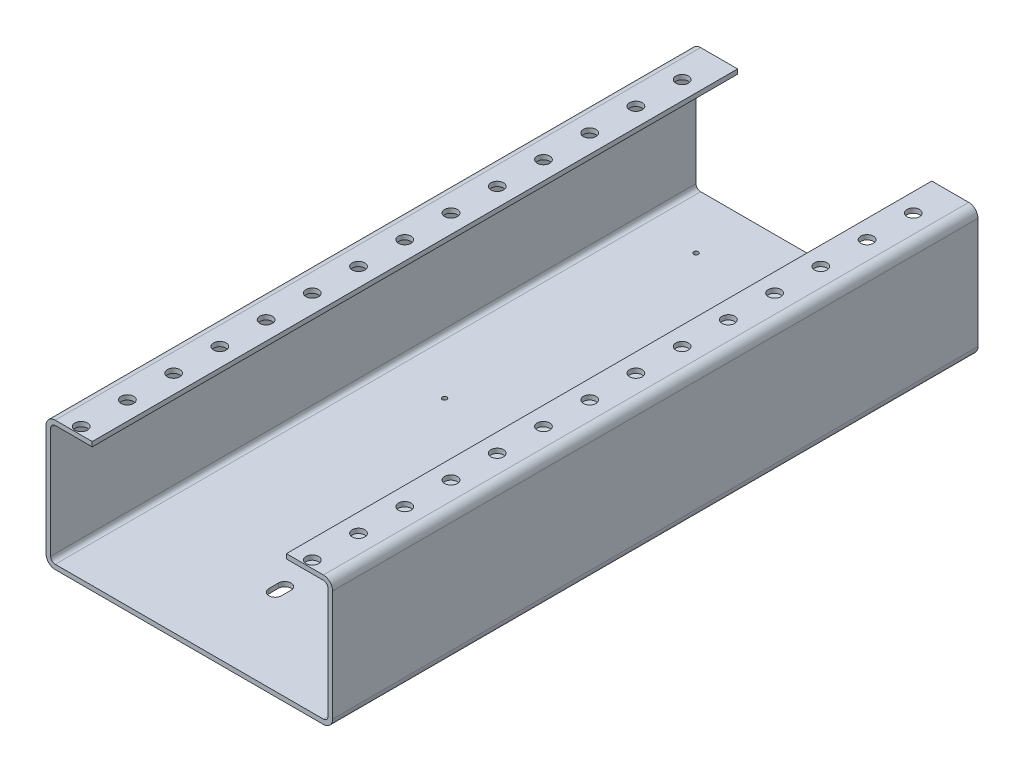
ISO-10303-21;
HEADER;
FILE_DESCRIPTION(('STEP AP214'),'2;1');
FILE_NAME('part.step','',(''),(''),'','','');
FILE_SCHEMA(('AUTOMOTIVE_DESIGN { 1 0 10303 214 1 1 1 1 }'));
ENDSEC;
DATA;
#1=APPLICATION_CONTEXT('core data for automotive mechanical design processes');
#2=APPLICATION_PROTOCOL_DEFINITION('international standard','automotive_design',2000,#1);
#3=PRODUCT_CONTEXT('',#1,'mechanical');
#4=PRODUCT('Part','Part','',(#3));
#5=PRODUCT_RELATED_PRODUCT_CATEGORY('part','',(#4));
#6=PRODUCT_DEFINITION_FORMATION('','',#4);
#7=PRODUCT_DEFINITION_CONTEXT('part definition',#1,'design');
#8=PRODUCT_DEFINITION('design','',#6,#7);
#9=PRODUCT_DEFINITION_SHAPE('','',#8);
#10=(LENGTH_UNIT() NAMED_UNIT(*) SI_UNIT(.MILLI.,.METRE.));
#11=(NAMED_UNIT(*) PLANE_ANGLE_UNIT() SI_UNIT($,.RADIAN.));
#12=(NAMED_UNIT(*) SI_UNIT($,.STERADIAN.) SOLID_ANGLE_UNIT());
#13=UNCERTAINTY_MEASURE_WITH_UNIT(LENGTH_MEASURE(1.E-05),#10,'distance_accuracy_value','');
#14=(GEOMETRIC_REPRESENTATION_CONTEXT(3) GLOBAL_UNCERTAINTY_ASSIGNED_CONTEXT((#13)) GLOBAL_UNIT_ASSIGNED_CONTEXT((#10,
#11,#12)) REPRESENTATION_CONTEXT('',''));
#15=CARTESIAN_POINT('',(0.,0.,0.));
#16=DIRECTION('',(0.,0.,1.));
#17=DIRECTION('',(1.,0.,0.));
#18=AXIS2_PLACEMENT_3D('',#15,#16,#17);
#19=CARTESIAN_POINT('',(-77.5000000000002,67.4999999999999,-1680.));
#20=DIRECTION('',(0.,-1.,0.));
#21=DIRECTION('',(1.,0.,0.));
#22=AXIS2_PLACEMENT_3D('',#19,#20,#21);
#23=PLANE('',#22);
#24=CARTESIAN_POINT('',(-62.5000000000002,67.5,-1335.));
#25=DIRECTION('',(0.,-1.,0.));
#26=DIRECTION('',(1.,0.,0.));
#27=AXIS2_PLACEMENT_3D('',#24,#25,#26);
#28=CIRCLE('',#27,3.4);
#29=CARTESIAN_POINT('',(-59.1000000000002,67.5,-1335.));
#30=VERTEX_POINT('',#29);
#31=EDGE_CURVE('E635',#30,#30,#28,.F.);
#32=ORIENTED_EDGE('',*,*,#31,.T.);
#33=EDGE_LOOP('',(#32));
#34=FACE_BOUND('',#33,.T.);
#35=CARTESIAN_POINT('',(-62.5,67.5,-1360.));
#36=DIRECTION('',(0.,-1.,0.));
#37=DIRECTION('',(1.,0.,0.));
#38=AXIS2_PLACEMENT_3D('',#35,#36,#37);
#39=CIRCLE('',#38,3.4);
#40=CARTESIAN_POINT('',(-59.1,67.5,-1360.));
#41=VERTEX_POINT('',#40);
#42=EDGE_CURVE('E623',#41,#41,#39,.F.);
#43=ORIENTED_EDGE('',*,*,#42,.T.);
#44=EDGE_LOOP('',(#43));
#45=FACE_BOUND('',#44,.T.);
#46=CARTESIAN_POINT('',(-62.5,67.5,-1385.));
#47=DIRECTION('',(0.,-1.,0.));
#48=DIRECTION('',(1.,0.,0.));
#49=AXIS2_PLACEMENT_3D('',#46,#47,#48);
#50=CIRCLE('',#49,3.4);
#51=CARTESIAN_POINT('',(-59.1,67.5,-1385.));
#52=VERTEX_POINT('',#51);
#53=EDGE_CURVE('E611',#52,#52,#50,.F.);
#54=ORIENTED_EDGE('',*,*,#53,.T.);
#55=EDGE_LOOP('',(#54));
#56=FACE_BOUND('',#55,.T.);
#57=CARTESIAN_POINT('',(-62.5000000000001,67.5,-1410.));
#58=DIRECTION('',(0.,-1.,0.));
#59=DIRECTION('',(1.,0.,0.));
#60=AXIS2_PLACEMENT_3D('',#57,#58,#59);
#61=CIRCLE('',#60,3.4);
#62=CARTESIAN_POINT('',(-59.1000000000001,67.5,-1410.));
#63=VERTEX_POINT('',#62);
#64=EDGE_CURVE('E599',#63,#63,#61,.F.);
#65=ORIENTED_EDGE('',*,*,#64,.T.);
#66=EDGE_LOOP('',(#65));
#67=FACE_BOUND('',#66,.T.);
#68=CARTESIAN_POINT('',(-62.5,67.5,-1435.));
#69=DIRECTION('',(0.,-1.,0.));
#70=DIRECTION('',(1.,0.,0.));
#71=AXIS2_PLACEMENT_3D('',#68,#69,#70);
#72=CIRCLE('',#71,3.4);
#73=CARTESIAN_POINT('',(-59.1,67.5,-1435.));
#74=VERTEX_POINT('',#73);
#75=EDGE_CURVE('E587',#74,#74,#72,.F.);
#76=ORIENTED_EDGE('',*,*,#75,.T.);
#77=EDGE_LOOP('',(#76));
#78=FACE_BOUND('',#77,.T.);
#79=CARTESIAN_POINT('',(-62.5000000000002,67.5,-1460.));
#80=DIRECTION('',(0.,-1.,0.));
#81=DIRECTION('',(1.,0.,0.));
#82=AXIS2_PLACEMENT_3D('',#79,#80,#81);
#83=CIRCLE('',#82,3.4);
#84=CARTESIAN_POINT('',(-59.1000000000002,67.5,-1460.));
#85=VERTEX_POINT('',#84);
#86=EDGE_CURVE('E575',#85,#85,#83,.F.);
#87=ORIENTED_EDGE('',*,*,#86,.T.);
#88=EDGE_LOOP('',(#87));
#89=FACE_BOUND('',#88,.T.);
#90=CARTESIAN_POINT('',(-62.5,67.5,-1485.));
#91=DIRECTION('',(0.,-1.,0.));
#92=DIRECTION('',(1.,0.,0.));
#93=AXIS2_PLACEMENT_3D('',#90,#91,#92);
#94=CIRCLE('',#93,3.4);
#95=CARTESIAN_POINT('',(-59.1,67.5,-1485.));
#96=VERTEX_POINT('',#95);
#97=EDGE_CURVE('E563',#96,#96,#94,.F.);
#98=ORIENTED_EDGE('',*,*,#97,.T.);
#99=EDGE_LOOP('',(#98));
#100=FACE_BOUND('',#99,.T.);
#101=CARTESIAN_POINT('',(-62.5,67.5,-1510.));
#102=DIRECTION('',(0.,-1.,0.));
#103=DIRECTION('',(1.,0.,0.));
#104=AXIS2_PLACEMENT_3D('',#101,#102,#103);
#105=CIRCLE('',#104,3.4);
#106=CARTESIAN_POINT('',(-59.1,67.5,-1510.));
#107=VERTEX_POINT('',#106);
#108=EDGE_CURVE('E551',#107,#107,#105,.F.);
#109=ORIENTED_EDGE('',*,*,#108,.T.);
#110=EDGE_LOOP('',(#109));
#111=FACE_BOUND('',#110,.T.);
#112=CARTESIAN_POINT('',(-62.4999999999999,67.5,-1535.));
#113=DIRECTION('',(0.,-1.,0.));
#114=DIRECTION('',(1.,0.,0.));
#115=AXIS2_PLACEMENT_3D('',#112,#113,#114);
#116=CIRCLE('',#115,3.4);
#117=CARTESIAN_POINT('',(-59.0999999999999,67.5,-1535.));
#118=VERTEX_POINT('',#117);
#119=EDGE_CURVE('E539',#118,#118,#116,.F.);
#120=ORIENTED_EDGE('',*,*,#119,.T.);
#121=EDGE_LOOP('',(#120));
#122=FACE_BOUND('',#121,.T.);
#123=CARTESIAN_POINT('',(-62.4999999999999,67.5,-1560.));
#124=DIRECTION('',(0.,-1.,0.));
#125=DIRECTION('',(1.,0.,0.));
#126=AXIS2_PLACEMENT_3D('',#123,#124,#125);
#127=CIRCLE('',#126,3.4);
#128=CARTESIAN_POINT('',(-59.0999999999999,67.5,-1560.));
#129=VERTEX_POINT('',#128);
#130=EDGE_CURVE('E527',#129,#129,#127,.F.);
#131=ORIENTED_EDGE('',*,*,#130,.T.);
#132=EDGE_LOOP('',(#131));
#133=FACE_BOUND('',#132,.T.);
#134=CARTESIAN_POINT('',(-62.5000000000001,67.5,-1585.));
#135=DIRECTION('',(0.,-1.,0.));
#136=DIRECTION('',(1.,0.,0.));
#137=AXIS2_PLACEMENT_3D('',#134,#135,#136);
#138=CIRCLE('',#137,3.4);
#139=CARTESIAN_POINT('',(-59.1000000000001,67.5,-1585.));
#140=VERTEX_POINT('',#139);
#141=EDGE_CURVE('E515',#140,#140,#138,.F.);
#142=ORIENTED_EDGE('',*,*,#141,.T.);
#143=EDGE_LOOP('',(#142));
#144=FACE_BOUND('',#143,.T.);
#145=CARTESIAN_POINT('',(-62.5,67.4999999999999,-1610.));
#146=DIRECTION('',(0.,-1.,0.));
#147=DIRECTION('',(1.,0.,0.));
#148=AXIS2_PLACEMENT_3D('',#145,#146,#147);
#149=CIRCLE('',#148,3.4);
#150=CARTESIAN_POINT('',(-59.1,67.4999999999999,-1610.));
#151=VERTEX_POINT('',#150);
#152=EDGE_CURVE('E503',#151,#151,#149,.F.);
#153=ORIENTED_EDGE('',*,*,#152,.T.);
#154=EDGE_LOOP('',(#153));
#155=FACE_BOUND('',#154,.T.);
#156=CARTESIAN_POINT('',(-62.4999999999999,67.4999999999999,-1635.));
#157=DIRECTION('',(0.,-1.,0.));
#158=DIRECTION('',(1.,0.,0.));
#159=AXIS2_PLACEMENT_3D('',#156,#157,#158);
#160=CIRCLE('',#159,3.4);
#161=CARTESIAN_POINT('',(-59.0999999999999,67.4999999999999,-1635.));
#162=VERTEX_POINT('',#161);
#163=EDGE_CURVE('E491',#162,#162,#160,.F.);
#164=ORIENTED_EDGE('',*,*,#163,.T.);
#165=EDGE_LOOP('',(#164));
#166=FACE_BOUND('',#165,.T.);
#167=CARTESIAN_POINT('',(-62.4999999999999,67.4999999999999,-1660.));
#168=DIRECTION('',(0.,-1.,0.));
#169=DIRECTION('',(1.,0.,0.));
#170=AXIS2_PLACEMENT_3D('',#167,#168,#169);
#171=CIRCLE('',#170,3.4);
#172=CARTESIAN_POINT('',(-59.0999999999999,67.4999999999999,-1660.));
#173=VERTEX_POINT('',#172);
#174=EDGE_CURVE('E479',#173,#173,#171,.F.);
#175=ORIENTED_EDGE('',*,*,#174,.T.);
#176=EDGE_LOOP('',(#175));
#177=FACE_BOUND('',#176,.T.);
#178=DIRECTION('',(0.,0.,1.));
#179=VECTOR('',#178,1.);
#180=CARTESIAN_POINT('',(-52.5,67.5,-1680.));
#181=LINE('',#180,#179);
#182=CARTESIAN_POINT('',(-52.5,67.5,-1680.));
#183=VERTEX_POINT('',#182);
#184=CARTESIAN_POINT('',(-52.4999999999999,67.5,-1330.98560754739));
#185=VERTEX_POINT('',#184);
#186=EDGE_CURVE('E275',#183,#185,#181,.T.);
#187=ORIENTED_EDGE('',*,*,#186,.T.);
#188=DIRECTION('',(-1.,0.,0.));
#189=VECTOR('',#188,1.);
#190=CARTESIAN_POINT('',(-77.5,67.4999999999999,-1330.98560754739));
#191=LINE('',#190,#189);
#192=CARTESIAN_POINT('',(-72.5,67.4999999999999,-1330.98560754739));
#193=VERTEX_POINT('',#192);
#194=EDGE_CURVE('E60',#185,#193,#191,.T.);
#195=ORIENTED_EDGE('',*,*,#194,.T.);
#196=DIRECTION('',(0.,0.,1.));
#197=VECTOR('',#196,1.);
#198=CARTESIAN_POINT('',(-72.5000000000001,67.4999999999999,-1680.));
#199=LINE('',#198,#197);
#200=CARTESIAN_POINT('',(-72.5000000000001,67.4999999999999,-1680.));
#201=VERTEX_POINT('',#200);
#202=EDGE_CURVE('E282',#201,#193,#199,.T.);
#203=ORIENTED_EDGE('',*,*,#202,.F.);
#204=DIRECTION('',(1.,0.,0.));
#205=VECTOR('',#204,1.);
#206=CARTESIAN_POINT('',(-77.5000000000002,67.4999999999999,-1680.));
#207=LINE('',#206,#205);
#208=EDGE_CURVE('E641',#201,#183,#207,.T.);
#209=ORIENTED_EDGE('',*,*,#208,.T.);
#210=EDGE_LOOP('',(#187,#195,#203,#209));
#211=FACE_BOUND('',#210,.T.);
#212=ADVANCED_FACE('F46',(#34,#45,#56,#67,#78,#89,#100,#111,#122,#133,#144,#155,#166,#177,#211),
#23,.T.);
#213=CARTESIAN_POINT('',(-72.5000000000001,64.9999999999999,-1680.));
#214=DIRECTION('',(0.,0.,1.));
#215=DIRECTION('',(1.,0.,0.));
#216=AXIS2_PLACEMENT_3D('',#213,#214,#215);
#217=CYLINDRICAL_SURFACE('',#216,2.5);
#218=ORIENTED_EDGE('',*,*,#202,.T.);
#219=CARTESIAN_POINT('',(-72.5,64.9999999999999,-1330.98560754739));
#220=DIRECTION('',(0.,0.,1.));
#221=DIRECTION('',(1.,0.,0.));
#222=AXIS2_PLACEMENT_3D('',#219,#220,#221);
#223=CIRCLE('',#222,2.5);
#224=CARTESIAN_POINT('',(-75.0000000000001,64.9999999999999,-1330.98560754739));
#225=VERTEX_POINT('',#224);
#226=EDGE_CURVE('E725',#193,#225,#223,.T.);
#227=ORIENTED_EDGE('',*,*,#226,.T.);
#228=DIRECTION('',(0.,0.,1.));
#229=VECTOR('',#228,1.);
#230=CARTESIAN_POINT('',(-75.0000000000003,64.9999999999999,-1680.));
#231=LINE('',#230,#229);
#232=CARTESIAN_POINT('',(-75.0000000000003,64.9999999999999,-1680.));
#233=VERTEX_POINT('',#232);
#234=EDGE_CURVE('E349',#233,#225,#231,.T.);
#235=ORIENTED_EDGE('',*,*,#234,.F.);
#236=CARTESIAN_POINT('',(-72.5000000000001,64.9999999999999,-1680.));
#237=DIRECTION('',(0.,0.,1.));
#238=DIRECTION('',(1.,0.,0.));
#239=AXIS2_PLACEMENT_3D('',#236,#237,#238);
#240=CIRCLE('',#239,2.5);
#241=EDGE_CURVE('E278',#233,#201,#240,.F.);
#242=ORIENTED_EDGE('',*,*,#241,.T.);
#243=EDGE_LOOP('',(#218,#227,#235,#242));
#244=FACE_BOUND('',#243,.T.);
#245=ADVANCED_FACE('F751',(#244),#217,.F.);
#246=CARTESIAN_POINT('',(-75.0000000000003,0.,-1680.));
#247=DIRECTION('',(1.,0.,0.));
#248=DIRECTION('',(0.,0.,-1.));
#249=AXIS2_PLACEMENT_3D('',#246,#247,#248);
#250=PLANE('',#249);
#251=ORIENTED_EDGE('',*,*,#234,.T.);
#252=DIRECTION('',(0.,-1.,0.));
#253=VECTOR('',#252,1.);
#254=CARTESIAN_POINT('',(-75.0000000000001,0.,-1330.98560754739));
#255=LINE('',#254,#253);
#256=CARTESIAN_POINT('',(-75.0000000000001,5.,-1330.98560754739));
#257=VERTEX_POINT('',#256);
#258=EDGE_CURVE('E723',#225,#257,#255,.T.);
#259=ORIENTED_EDGE('',*,*,#258,.T.);
#260=DIRECTION('',(0.,0.,1.));
#261=VECTOR('',#260,1.);
#262=CARTESIAN_POINT('',(-75.0000000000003,5.,-1680.));
#263=LINE('',#262,#261);
#264=CARTESIAN_POINT('',(-75.0000000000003,5.,-1680.));
#265=VERTEX_POINT('',#264);
#266=EDGE_CURVE('E352',#265,#257,#263,.T.);
#267=ORIENTED_EDGE('',*,*,#266,.F.);
#268=DIRECTION('',(0.,1.,0.));
#269=VECTOR('',#268,1.);
#270=CARTESIAN_POINT('',(-75.0000000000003,0.,-1680.));
#271=LINE('',#270,#269);
#272=EDGE_CURVE('E342',#265,#233,#271,.T.);
#273=ORIENTED_EDGE('',*,*,#272,.T.);
#274=EDGE_LOOP('',(#251,#259,#267,#273));
#275=FACE_BOUND('',#274,.T.);
#276=ADVANCED_FACE('F757',(#275),#250,.T.);
#277=CARTESIAN_POINT('',(-72.5000000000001,5.,-1680.));
#278=DIRECTION('',(0.,0.,1.));
#279=DIRECTION('',(1.,0.,0.));
#280=AXIS2_PLACEMENT_3D('',#277,#278,#279);
#281=CYLINDRICAL_SURFACE('',#280,2.5);
#282=ORIENTED_EDGE('',*,*,#266,.T.);
#283=CARTESIAN_POINT('',(-72.5000000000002,5.,-1330.98560754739));
#284=DIRECTION('',(0.,0.,1.));
#285=DIRECTION('',(1.,0.,0.));
#286=AXIS2_PLACEMENT_3D('',#283,#284,#285);
#287=CIRCLE('',#286,2.5);
#288=CARTESIAN_POINT('',(-72.5000000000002,2.49999999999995,-1330.98560754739));
#289=VERTEX_POINT('',#288);
#290=EDGE_CURVE('E719',#257,#289,#287,.T.);
#291=ORIENTED_EDGE('',*,*,#290,.T.);
#292=DIRECTION('',(0.,0.,1.));
#293=VECTOR('',#292,1.);
#294=CARTESIAN_POINT('',(-72.5000000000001,2.49999999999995,-1680.));
#295=LINE('',#294,#293);
#296=CARTESIAN_POINT('',(-72.5000000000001,2.49999999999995,-1680.));
#297=VERTEX_POINT('',#296);
#298=EDGE_CURVE('E355',#297,#289,#295,.T.);
#299=ORIENTED_EDGE('',*,*,#298,.F.);
#300=CARTESIAN_POINT('',(-72.5000000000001,5.,-1680.));
#301=DIRECTION('',(0.,0.,1.));
#302=DIRECTION('',(1.,0.,0.));
#303=AXIS2_PLACEMENT_3D('',#300,#301,#302);
#304=CIRCLE('',#303,2.5);
#305=EDGE_CURVE('E339',#297,#265,#304,.F.);
#306=ORIENTED_EDGE('',*,*,#305,.T.);
#307=EDGE_LOOP('',(#282,#291,#299,#306));
#308=FACE_BOUND('',#307,.T.);
#309=ADVANCED_FACE('F722',(#308),#281,.F.);
#310=CARTESIAN_POINT('',(-77.5000000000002,2.49999999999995,-1680.));
#311=DIRECTION('',(0.,1.,0.));
#312=DIRECTION('',(-1.,0.,0.));
#313=AXIS2_PLACEMENT_3D('',#310,#311,#312);
#314=PLANE('',#313);
#315=CARTESIAN_POINT('',(0.,2.49999999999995,-1377.4));
#316=DIRECTION('',(0.,1.,0.));
#317=DIRECTION('',(-1.,0.,0.));
#318=AXIS2_PLACEMENT_3D('',#315,#316,#317);
#319=CIRCLE('',#318,3.4);
#320=CARTESIAN_POINT('',(3.39999999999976,2.49999999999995,-1377.4));
#321=VERTEX_POINT('',#320);
#322=CARTESIAN_POINT('',(-3.40000000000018,2.49999999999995,-1377.4));
#323=VERTEX_POINT('',#322);
#324=EDGE_CURVE('E447',#321,#323,#319,.F.);
#325=ORIENTED_EDGE('',*,*,#324,.T.);
#326=DIRECTION('',(0.,0.,-1.));
#327=VECTOR('',#326,1.);
#328=CARTESIAN_POINT('',(-3.40000000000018,2.49999999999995,-1377.4));
#329=LINE('',#328,#327);
#330=CARTESIAN_POINT('',(-3.40000000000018,2.49999999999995,-1382.6));
#331=VERTEX_POINT('',#330);
#332=EDGE_CURVE('E464',#323,#331,#329,.T.);
#333=ORIENTED_EDGE('',*,*,#332,.T.);
#334=CARTESIAN_POINT('',(0.,2.49999999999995,-1382.6));
#335=DIRECTION('',(0.,1.,0.));
#336=DIRECTION('',(-1.,0.,0.));
#337=AXIS2_PLACEMENT_3D('',#334,#335,#336);
#338=CIRCLE('',#337,3.4);
#339=CARTESIAN_POINT('',(3.39999999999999,2.49999999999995,-1382.6));
#340=VERTEX_POINT('',#339);
#341=EDGE_CURVE('E441',#331,#340,#338,.F.);
#342=ORIENTED_EDGE('',*,*,#341,.T.);
#343=DIRECTION('',(0.,0.,1.));
#344=VECTOR('',#343,1.);
#345=CARTESIAN_POINT('',(3.39999999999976,2.49999999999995,-1377.4));
#346=LINE('',#345,#344);
#347=EDGE_CURVE('E444',#340,#321,#346,.T.);
#348=ORIENTED_EDGE('',*,*,#347,.T.);
#349=EDGE_LOOP('',(#325,#333,#342,#348));
#350=FACE_BOUND('',#349,.T.);
#351=CARTESIAN_POINT('',(0.,2.49999999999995,-1417.4));
#352=DIRECTION('',(0.,1.,0.));
#353=DIRECTION('',(-1.,0.,0.));
#354=AXIS2_PLACEMENT_3D('',#351,#352,#353);
#355=CIRCLE('',#354,3.4);
#356=CARTESIAN_POINT('',(3.39999999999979,2.49999999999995,-1417.4));
#357=VERTEX_POINT('',#356);
#358=CARTESIAN_POINT('',(-3.40000000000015,2.49999999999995,-1417.4));
#359=VERTEX_POINT('',#358);
#360=EDGE_CURVE('E438',#357,#359,#355,.F.);
#361=ORIENTED_EDGE('',*,*,#360,.T.);
#362=DIRECTION('',(0.,0.,-1.));
#363=VECTOR('',#362,1.);
#364=CARTESIAN_POINT('',(-3.40000000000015,2.49999999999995,-1417.4));
#365=LINE('',#364,#363);
#366=CARTESIAN_POINT('',(-3.40000000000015,2.49999999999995,-1422.6));
#367=VERTEX_POINT('',#366);
#368=EDGE_CURVE('E414',#359,#367,#365,.T.);
#369=ORIENTED_EDGE('',*,*,#368,.T.);
#370=CARTESIAN_POINT('',(0.,2.49999999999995,-1422.6));
#371=DIRECTION('',(0.,1.,0.));
#372=DIRECTION('',(-1.,0.,0.));
#373=AXIS2_PLACEMENT_3D('',#370,#371,#372);
#374=CIRCLE('',#373,3.4);
#375=CARTESIAN_POINT('',(3.40000000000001,2.49999999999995,-1422.6));
#376=VERTEX_POINT('',#375);
#377=EDGE_CURVE('E68',#367,#376,#374,.F.);
#378=ORIENTED_EDGE('',*,*,#377,.T.);
#379=DIRECTION('',(0.,0.,1.));
#380=VECTOR('',#379,1.);
#381=CARTESIAN_POINT('',(3.39999999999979,2.49999999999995,-1417.4));
#382=LINE('',#381,#380);
#383=EDGE_CURVE('E433',#376,#357,#382,.T.);
#384=ORIENTED_EDGE('',*,*,#383,.T.);
#385=EDGE_LOOP('',(#361,#369,#378,#384));
#386=FACE_BOUND('',#385,.T.);
#387=CARTESIAN_POINT('',(-45.,2.49999999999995,-1650.));
#388=DIRECTION('',(0.,1.,0.));
#389=DIRECTION('',(-1.,0.,0.));
#390=AXIS2_PLACEMENT_3D('',#387,#388,#389);
#391=CIRCLE('',#390,1.24999999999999);
#392=CARTESIAN_POINT('',(-46.25,2.49999999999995,-1650.));
#393=VERTEX_POINT('',#392);
#394=EDGE_CURVE('E409',#393,#393,#391,.T.);
#395=ORIENTED_EDGE('',*,*,#394,.F.);
#396=EDGE_LOOP('',(#395));
#397=FACE_BOUND('',#396,.T.);
#398=CARTESIAN_POINT('',(44.9999999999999,2.50000000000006,-1650.));
#399=DIRECTION('',(0.,1.,0.));
#400=DIRECTION('',(-1.,0.,0.));
#401=AXIS2_PLACEMENT_3D('',#398,#399,#400);
#402=CIRCLE('',#401,1.24999999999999);
#403=CARTESIAN_POINT('',(43.7499999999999,2.50000000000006,-1650.));
#404=VERTEX_POINT('',#403);
#405=EDGE_CURVE('E403',#404,#404,#402,.T.);
#406=ORIENTED_EDGE('',*,*,#405,.F.);
#407=EDGE_LOOP('',(#406));
#408=FACE_BOUND('',#407,.T.);
#409=CARTESIAN_POINT('',(-45.,2.49999999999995,-1514.));
#410=DIRECTION('',(0.,1.,0.));
#411=DIRECTION('',(-1.,0.,0.));
#412=AXIS2_PLACEMENT_3D('',#409,#410,#411);
#413=CIRCLE('',#412,1.24999999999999);
#414=CARTESIAN_POINT('',(-46.25,2.49999999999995,-1514.));
#415=VERTEX_POINT('',#414);
#416=EDGE_CURVE('E397',#415,#415,#413,.T.);
#417=ORIENTED_EDGE('',*,*,#416,.F.);
#418=EDGE_LOOP('',(#417));
#419=FACE_BOUND('',#418,.T.);
#420=CARTESIAN_POINT('',(45.,2.49999999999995,-1514.));
#421=DIRECTION('',(0.,1.,0.));
#422=DIRECTION('',(-1.,0.,0.));
#423=AXIS2_PLACEMENT_3D('',#420,#421,#422);
#424=CIRCLE('',#423,1.24999999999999);
#425=CARTESIAN_POINT('',(43.75,2.49999999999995,-1514.));
#426=VERTEX_POINT('',#425);
#427=EDGE_CURVE('E388',#426,#426,#424,.T.);
#428=ORIENTED_EDGE('',*,*,#427,.F.);
#429=EDGE_LOOP('',(#428));
#430=FACE_BOUND('',#429,.T.);
#431=ORIENTED_EDGE('',*,*,#298,.T.);
#432=DIRECTION('',(1.,0.,0.));
#433=VECTOR('',#432,1.);
#434=CARTESIAN_POINT('',(-77.5,2.49999999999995,-1330.98560754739));
#435=LINE('',#434,#433);
#436=CARTESIAN_POINT('',(72.5000000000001,2.50000000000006,-1330.98560754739));
#437=VERTEX_POINT('',#436);
#438=EDGE_CURVE('E680',#289,#437,#435,.T.);
#439=ORIENTED_EDGE('',*,*,#438,.T.);
#440=DIRECTION('',(0.,0.,1.));
#441=VECTOR('',#440,1.);
#442=CARTESIAN_POINT('',(72.4999999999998,2.49999999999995,-1680.));
#443=LINE('',#442,#441);
#444=CARTESIAN_POINT('',(72.4999999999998,2.49999999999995,-1680.));
#445=VERTEX_POINT('',#444);
#446=EDGE_CURVE('E358',#445,#437,#443,.T.);
#447=ORIENTED_EDGE('',*,*,#446,.F.);
#448=DIRECTION('',(-1.,0.,0.));
#449=VECTOR('',#448,1.);
#450=CARTESIAN_POINT('',(-77.5000000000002,2.49999999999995,-1680.));
#451=LINE('',#450,#449);
#452=EDGE_CURVE('E336',#445,#297,#451,.T.);
#453=ORIENTED_EDGE('',*,*,#452,.T.);
#454=EDGE_LOOP('',(#431,#439,#447,#453));
#455=FACE_BOUND('',#454,.T.);
#456=ADVANCED_FACE('F715',(#350,#386,#397,#408,#419,#430,#455),#314,.T.);
#457=CARTESIAN_POINT('',(72.4999999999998,5.,-1680.));
#458=DIRECTION('',(0.,0.,1.));
#459=DIRECTION('',(1.,0.,0.));
#460=AXIS2_PLACEMENT_3D('',#457,#458,#459);
#461=CYLINDRICAL_SURFACE('',#460,2.5);
#462=ORIENTED_EDGE('',*,*,#446,.T.);
#463=CARTESIAN_POINT('',(72.5000000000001,5.,-1330.98560754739));
#464=DIRECTION('',(0.,0.,1.));
#465=DIRECTION('',(1.,0.,0.));
#466=AXIS2_PLACEMENT_3D('',#463,#464,#465);
#467=CIRCLE('',#466,2.5);
#468=CARTESIAN_POINT('',(75.,5.,-1330.98560754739));
#469=VERTEX_POINT('',#468);
#470=EDGE_CURVE('E676',#437,#469,#467,.T.);
#471=ORIENTED_EDGE('',*,*,#470,.T.);
#472=DIRECTION('',(0.,0.,1.));
#473=VECTOR('',#472,1.);
#474=CARTESIAN_POINT('',(75.,5.,-1680.));
#475=LINE('',#474,#473);
#476=CARTESIAN_POINT('',(75.,5.,-1680.));
#477=VERTEX_POINT('',#476);
#478=EDGE_CURVE('E361',#477,#469,#475,.T.);
#479=ORIENTED_EDGE('',*,*,#478,.F.);
#480=CARTESIAN_POINT('',(72.4999999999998,5.,-1680.));
#481=DIRECTION('',(0.,0.,1.));
#482=DIRECTION('',(1.,0.,0.));
#483=AXIS2_PLACEMENT_3D('',#480,#481,#482);
#484=CIRCLE('',#483,2.5);
#485=EDGE_CURVE('E333',#477,#445,#484,.F.);
#486=ORIENTED_EDGE('',*,*,#485,.T.);
#487=EDGE_LOOP('',(#462,#471,#479,#486));
#488=FACE_BOUND('',#487,.T.);
#489=ADVANCED_FACE('F717',(#488),#461,.F.);
#490=CARTESIAN_POINT('',(75.,0.,-1680.));
#491=DIRECTION('',(-1.,0.,0.));
#492=DIRECTION('',(0.,0.,1.));
#493=AXIS2_PLACEMENT_3D('',#490,#491,#492);
#494=PLANE('',#493);
#495=ORIENTED_EDGE('',*,*,#478,.T.);
#496=DIRECTION('',(0.,1.,0.));
#497=VECTOR('',#496,1.);
#498=CARTESIAN_POINT('',(75.,0.,-1330.98560754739));
#499=LINE('',#498,#497);
#500=CARTESIAN_POINT('',(74.9999999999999,64.9999999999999,-1330.98560754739));
#501=VERTEX_POINT('',#500);
#502=EDGE_CURVE('E674',#469,#501,#499,.T.);
#503=ORIENTED_EDGE('',*,*,#502,.T.);
#504=DIRECTION('',(0.,0.,1.));
#505=VECTOR('',#504,1.);
#506=CARTESIAN_POINT('',(75.,64.9999999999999,-1680.));
#507=LINE('',#506,#505);
#508=CARTESIAN_POINT('',(75.,64.9999999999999,-1680.));
#509=VERTEX_POINT('',#508);
#510=EDGE_CURVE('E317',#509,#501,#507,.T.);
#511=ORIENTED_EDGE('',*,*,#510,.F.);
#512=DIRECTION('',(0.,1.,0.));
#513=VECTOR('',#512,1.);
#514=CARTESIAN_POINT('',(75.,0.,-1680.));
#515=LINE('',#514,#513);
#516=EDGE_CURVE('E321',#509,#477,#515,.F.);
#517=ORIENTED_EDGE('',*,*,#516,.T.);
#518=EDGE_LOOP('',(#495,#503,#511,#517));
#519=FACE_BOUND('',#518,.T.);
#520=ADVANCED_FACE('F672',(#519),#494,.T.);
#521=CARTESIAN_POINT('',(72.5000000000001,64.9999999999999,-1680.));
#522=DIRECTION('',(0.,0.,1.));
#523=DIRECTION('',(1.,0.,0.));
#524=AXIS2_PLACEMENT_3D('',#521,#522,#523);
#525=CYLINDRICAL_SURFACE('',#524,2.5);
#526=ORIENTED_EDGE('',*,*,#510,.T.);
#527=CARTESIAN_POINT('',(72.5000000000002,64.9999999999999,-1330.98560754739));
#528=DIRECTION('',(0.,0.,1.));
#529=DIRECTION('',(1.,0.,0.));
#530=AXIS2_PLACEMENT_3D('',#527,#528,#529);
#531=CIRCLE('',#530,2.5);
#532=CARTESIAN_POINT('',(72.5000000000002,67.4999999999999,-1330.98560754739));
#533=VERTEX_POINT('',#532);
#534=EDGE_CURVE('E314',#501,#533,#531,.T.);
#535=ORIENTED_EDGE('',*,*,#534,.T.);
#536=DIRECTION('',(0.,0.,1.));
#537=VECTOR('',#536,1.);
#538=CARTESIAN_POINT('',(72.5000000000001,67.4999999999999,-1680.));
#539=LINE('',#538,#537);
#540=CARTESIAN_POINT('',(72.5000000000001,67.4999999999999,-1680.));
#541=VERTEX_POINT('',#540);
#542=EDGE_CURVE('E310',#541,#533,#539,.T.);
#543=ORIENTED_EDGE('',*,*,#542,.F.);
#544=CARTESIAN_POINT('',(72.5000000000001,64.9999999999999,-1680.));
#545=DIRECTION('',(0.,0.,1.));
#546=DIRECTION('',(1.,0.,0.));
#547=AXIS2_PLACEMENT_3D('',#544,#545,#546);
#548=CIRCLE('',#547,2.5);
#549=EDGE_CURVE('E313',#541,#509,#548,.F.);
#550=ORIENTED_EDGE('',*,*,#549,.T.);
#551=EDGE_LOOP('',(#526,#535,#543,#550));
#552=FACE_BOUND('',#551,.T.);
#553=ADVANCED_FACE('F312',(#552),#525,.F.);
#554=CARTESIAN_POINT('',(77.4999999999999,67.4999999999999,-1680.));
#555=DIRECTION('',(0.,-1.,0.));
#556=DIRECTION('',(1.,0.,0.));
#557=AXIS2_PLACEMENT_3D('',#554,#555,#556);
#558=PLANE('',#557);
#559=CARTESIAN_POINT('',(62.4999999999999,67.4999999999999,-1335.));
#560=DIRECTION('',(0.,-1.,0.));
#561=DIRECTION('',(1.,0.,0.));
#562=AXIS2_PLACEMENT_3D('',#559,#560,#561);
#563=CIRCLE('',#562,3.4);
#564=CARTESIAN_POINT('',(65.8999999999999,67.4999999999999,-1335.));
#565=VERTEX_POINT('',#564);
#566=EDGE_CURVE('E629',#565,#565,#563,.F.);
#567=ORIENTED_EDGE('',*,*,#566,.T.);
#568=EDGE_LOOP('',(#567));
#569=FACE_BOUND('',#568,.T.);
#570=CARTESIAN_POINT('',(62.4999999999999,67.4999999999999,-1360.));
#571=DIRECTION('',(0.,-1.,0.));
#572=DIRECTION('',(1.,0.,0.));
#573=AXIS2_PLACEMENT_3D('',#570,#571,#572);
#574=CIRCLE('',#573,3.4);
#575=CARTESIAN_POINT('',(65.8999999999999,67.4999999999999,-1360.));
#576=VERTEX_POINT('',#575);
#577=EDGE_CURVE('E617',#576,#576,#574,.F.);
#578=ORIENTED_EDGE('',*,*,#577,.T.);
#579=EDGE_LOOP('',(#578));
#580=FACE_BOUND('',#579,.T.);
#581=CARTESIAN_POINT('',(62.4999999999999,67.4999999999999,-1385.));
#582=DIRECTION('',(0.,-1.,0.));
#583=DIRECTION('',(1.,0.,0.));
#584=AXIS2_PLACEMENT_3D('',#581,#582,#583);
#585=CIRCLE('',#584,3.4);
#586=CARTESIAN_POINT('',(65.8999999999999,67.4999999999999,-1385.));
#587=VERTEX_POINT('',#586);
#588=EDGE_CURVE('E605',#587,#587,#585,.F.);
#589=ORIENTED_EDGE('',*,*,#588,.T.);
#590=EDGE_LOOP('',(#589));
#591=FACE_BOUND('',#590,.T.);
#592=CARTESIAN_POINT('',(62.4999999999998,67.4999999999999,-1410.));
#593=DIRECTION('',(0.,-1.,0.));
#594=DIRECTION('',(1.,0.,0.));
#595=AXIS2_PLACEMENT_3D('',#592,#593,#594);
#596=CIRCLE('',#595,3.4);
#597=CARTESIAN_POINT('',(65.8999999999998,67.4999999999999,-1410.));
#598=VERTEX_POINT('',#597);
#599=EDGE_CURVE('E593',#598,#598,#596,.F.);
#600=ORIENTED_EDGE('',*,*,#599,.T.);
#601=EDGE_LOOP('',(#600));
#602=FACE_BOUND('',#601,.T.);
#603=CARTESIAN_POINT('',(62.5,67.4999999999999,-1435.));
#604=DIRECTION('',(0.,-1.,0.));
#605=DIRECTION('',(1.,0.,0.));
#606=AXIS2_PLACEMENT_3D('',#603,#604,#605);
#607=CIRCLE('',#606,3.4);
#608=CARTESIAN_POINT('',(65.9,67.4999999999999,-1435.));
#609=VERTEX_POINT('',#608);
#610=EDGE_CURVE('E581',#609,#609,#607,.F.);
#611=ORIENTED_EDGE('',*,*,#610,.T.);
#612=EDGE_LOOP('',(#611));
#613=FACE_BOUND('',#612,.T.);
#614=CARTESIAN_POINT('',(62.4999999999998,67.4999999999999,-1460.));
#615=DIRECTION('',(0.,-1.,0.));
#616=DIRECTION('',(1.,0.,0.));
#617=AXIS2_PLACEMENT_3D('',#614,#615,#616);
#618=CIRCLE('',#617,3.4);
#619=CARTESIAN_POINT('',(65.8999999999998,67.4999999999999,-1460.));
#620=VERTEX_POINT('',#619);
#621=EDGE_CURVE('E569',#620,#620,#618,.F.);
#622=ORIENTED_EDGE('',*,*,#621,.T.);
#623=EDGE_LOOP('',(#622));
#624=FACE_BOUND('',#623,.T.);
#625=CARTESIAN_POINT('',(62.4999999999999,67.4999999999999,-1485.));
#626=DIRECTION('',(0.,-1.,0.));
#627=DIRECTION('',(1.,0.,0.));
#628=AXIS2_PLACEMENT_3D('',#625,#626,#627);
#629=CIRCLE('',#628,3.4);
#630=CARTESIAN_POINT('',(65.8999999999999,67.4999999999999,-1485.));
#631=VERTEX_POINT('',#630);
#632=EDGE_CURVE('E557',#631,#631,#629,.F.);
#633=ORIENTED_EDGE('',*,*,#632,.T.);
#634=EDGE_LOOP('',(#633));
#635=FACE_BOUND('',#634,.T.);
#636=CARTESIAN_POINT('',(62.4999999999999,67.4999999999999,-1510.));
#637=DIRECTION('',(0.,-1.,0.));
#638=DIRECTION('',(1.,0.,0.));
#639=AXIS2_PLACEMENT_3D('',#636,#637,#638);
#640=CIRCLE('',#639,3.4);
#641=CARTESIAN_POINT('',(65.8999999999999,67.4999999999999,-1510.));
#642=VERTEX_POINT('',#641);
#643=EDGE_CURVE('E545',#642,#642,#640,.F.);
#644=ORIENTED_EDGE('',*,*,#643,.T.);
#645=EDGE_LOOP('',(#644));
#646=FACE_BOUND('',#645,.T.);
#647=CARTESIAN_POINT('',(62.4999999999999,67.4999999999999,-1535.));
#648=DIRECTION('',(0.,-1.,0.));
#649=DIRECTION('',(1.,0.,0.));
#650=AXIS2_PLACEMENT_3D('',#647,#648,#649);
#651=CIRCLE('',#650,3.4);
#652=CARTESIAN_POINT('',(65.8999999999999,67.4999999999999,-1535.));
#653=VERTEX_POINT('',#652);
#654=EDGE_CURVE('E533',#653,#653,#651,.F.);
#655=ORIENTED_EDGE('',*,*,#654,.T.);
#656=EDGE_LOOP('',(#655));
#657=FACE_BOUND('',#656,.T.);
#658=CARTESIAN_POINT('',(62.5000000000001,67.4999999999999,-1560.));
#659=DIRECTION('',(0.,-1.,0.));
#660=DIRECTION('',(1.,0.,0.));
#661=AXIS2_PLACEMENT_3D('',#658,#659,#660);
#662=CIRCLE('',#661,3.4);
#663=CARTESIAN_POINT('',(65.9000000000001,67.4999999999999,-1560.));
#664=VERTEX_POINT('',#663);
#665=EDGE_CURVE('E521',#664,#664,#662,.F.);
#666=ORIENTED_EDGE('',*,*,#665,.T.);
#667=EDGE_LOOP('',(#666));
#668=FACE_BOUND('',#667,.T.);
#669=CARTESIAN_POINT('',(62.4999999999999,67.5,-1585.));
#670=DIRECTION('',(0.,-1.,0.));
#671=DIRECTION('',(1.,0.,0.));
#672=AXIS2_PLACEMENT_3D('',#669,#670,#671);
#673=CIRCLE('',#672,3.4);
#674=CARTESIAN_POINT('',(65.8999999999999,67.5,-1585.));
#675=VERTEX_POINT('',#674);
#676=EDGE_CURVE('E509',#675,#675,#673,.F.);
#677=ORIENTED_EDGE('',*,*,#676,.T.);
#678=EDGE_LOOP('',(#677));
#679=FACE_BOUND('',#678,.T.);
#680=CARTESIAN_POINT('',(62.5,67.4999999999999,-1610.));
#681=DIRECTION('',(0.,-1.,0.));
#682=DIRECTION('',(1.,0.,0.));
#683=AXIS2_PLACEMENT_3D('',#680,#681,#682);
#684=CIRCLE('',#683,3.4);
#685=CARTESIAN_POINT('',(65.9,67.4999999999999,-1610.));
#686=VERTEX_POINT('',#685);
#687=EDGE_CURVE('E497',#686,#686,#684,.F.);
#688=ORIENTED_EDGE('',*,*,#687,.T.);
#689=EDGE_LOOP('',(#688));
#690=FACE_BOUND('',#689,.T.);
#691=CARTESIAN_POINT('',(62.5,67.4999999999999,-1635.));
#692=DIRECTION('',(0.,-1.,0.));
#693=DIRECTION('',(1.,0.,0.));
#694=AXIS2_PLACEMENT_3D('',#691,#692,#693);
#695=CIRCLE('',#694,3.4);
#696=CARTESIAN_POINT('',(65.9,67.4999999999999,-1635.));
#697=VERTEX_POINT('',#696);
#698=EDGE_CURVE('E485',#697,#697,#695,.F.);
#699=ORIENTED_EDGE('',*,*,#698,.T.);
#700=EDGE_LOOP('',(#699));
#701=FACE_BOUND('',#700,.T.);
#702=CARTESIAN_POINT('',(62.5,67.4999999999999,-1660.));
#703=DIRECTION('',(0.,-1.,0.));
#704=DIRECTION('',(1.,0.,0.));
#705=AXIS2_PLACEMENT_3D('',#702,#703,#704);
#706=CIRCLE('',#705,3.4);
#707=CARTESIAN_POINT('',(65.9,67.4999999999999,-1660.));
#708=VERTEX_POINT('',#707);
#709=EDGE_CURVE('E473',#708,#708,#706,.F.);
#710=ORIENTED_EDGE('',*,*,#709,.T.);
#711=EDGE_LOOP('',(#710));
#712=FACE_BOUND('',#711,.T.);
#713=ORIENTED_EDGE('',*,*,#542,.T.);
#714=DIRECTION('',(-1.,0.,0.));
#715=VECTOR('',#714,1.);
#716=CARTESIAN_POINT('',(77.5,67.4999999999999,-1330.98560754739));
#717=LINE('',#716,#715);
#718=CARTESIAN_POINT('',(52.5,67.5,-1330.98560754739));
#719=VERTEX_POINT('',#718);
#720=EDGE_CURVE('E678',#533,#719,#717,.T.);
#721=ORIENTED_EDGE('',*,*,#720,.T.);
#722=DIRECTION('',(0.,0.,1.));
#723=VECTOR('',#722,1.);
#724=CARTESIAN_POINT('',(52.4999999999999,67.4999999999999,-1680.));
#725=LINE('',#724,#723);
#726=CARTESIAN_POINT('',(52.4999999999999,67.4999999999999,-1680.));
#727=VERTEX_POINT('',#726);
#728=EDGE_CURVE('E318',#727,#719,#725,.T.);
#729=ORIENTED_EDGE('',*,*,#728,.F.);
#730=DIRECTION('',(1.,0.,0.));
#731=VECTOR('',#730,1.);
#732=CARTESIAN_POINT('',(77.4999999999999,67.4999999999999,-1680.));
#733=LINE('',#732,#731);
#734=EDGE_CURVE('E299',#727,#541,#733,.T.);
#735=ORIENTED_EDGE('',*,*,#734,.T.);
#736=EDGE_LOOP('',(#713,#721,#729,#735));
#737=FACE_BOUND('',#736,.T.);
#738=ADVANCED_FACE('F323',(#569,#580,#591,#602,#613,#624,#635,#646,#657,#668,#679,#690,#701,
#712,#737),#558,.T.);
#739=CARTESIAN_POINT('',(52.4999999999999,67.4999999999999,-1680.));
#740=DIRECTION('',(1.,0.,0.));
#741=DIRECTION('',(0.,0.,-1.));
#742=AXIS2_PLACEMENT_3D('',#739,#740,#741);
#743=PLANE('',#742);
#744=DIRECTION('',(0.,-1.,0.));
#745=VECTOR('',#744,1.);
#746=CARTESIAN_POINT('',(52.5,67.5,-1330.98560754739));
#747=LINE('',#746,#745);
#748=CARTESIAN_POINT('',(52.5,70.,-1330.98560754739));
#749=VERTEX_POINT('',#748);
#750=EDGE_CURVE('E685',#749,#719,#747,.T.);
#751=ORIENTED_EDGE('',*,*,#750,.F.);
#752=DIRECTION('',(0.,0.,1.));
#753=VECTOR('',#752,1.);
#754=CARTESIAN_POINT('',(52.4999999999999,70.,-1680.));
#755=LINE('',#754,#753);
#756=CARTESIAN_POINT('',(52.4999999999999,70.,-1680.));
#757=VERTEX_POINT('',#756);
#758=EDGE_CURVE('E366',#757,#749,#755,.T.);
#759=ORIENTED_EDGE('',*,*,#758,.F.);
#760=DIRECTION('',(0.,1.,0.));
#761=VECTOR('',#760,1.);
#762=CARTESIAN_POINT('',(52.4999999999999,67.4999999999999,-1680.));
#763=LINE('',#762,#761);
#764=EDGE_CURVE('E326',#727,#757,#763,.T.);
#765=ORIENTED_EDGE('',*,*,#764,.F.);
#766=ORIENTED_EDGE('',*,*,#728,.T.);
#767=EDGE_LOOP('',(#751,#759,#765,#766));
#768=FACE_BOUND('',#767,.T.);
#769=ADVANCED_FACE('F737',(#768),#743,.F.);
#770=CARTESIAN_POINT('',(77.4999999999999,70.,-1680.));
#771=DIRECTION('',(0.,-1.,0.));
#772=DIRECTION('',(1.,0.,0.));
#773=AXIS2_PLACEMENT_3D('',#770,#771,#772);
#774=PLANE('',#773);
#775=CARTESIAN_POINT('',(62.4999999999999,70.,-1335.));
#776=DIRECTION('',(0.,1.,0.));
#777=DIRECTION('',(-1.,0.,0.));
#778=AXIS2_PLACEMENT_3D('',#775,#776,#777);
#779=CIRCLE('',#778,3.4);
#780=CARTESIAN_POINT('',(59.0999999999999,70.,-1335.));
#781=VERTEX_POINT('',#780);
#782=EDGE_CURVE('E632',#781,#781,#779,.T.);
#783=ORIENTED_EDGE('',*,*,#782,.F.);
#784=EDGE_LOOP('',(#783));
#785=FACE_BOUND('',#784,.T.);
#786=CARTESIAN_POINT('',(62.4999999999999,70.,-1360.));
#787=DIRECTION('',(0.,1.,0.));
#788=DIRECTION('',(-1.,0.,0.));
#789=AXIS2_PLACEMENT_3D('',#786,#787,#788);
#790=CIRCLE('',#789,3.4);
#791=CARTESIAN_POINT('',(59.0999999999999,70.,-1360.));
#792=VERTEX_POINT('',#791);
#793=EDGE_CURVE('E620',#792,#792,#790,.T.);
#794=ORIENTED_EDGE('',*,*,#793,.F.);
#795=EDGE_LOOP('',(#794));
#796=FACE_BOUND('',#795,.T.);
#797=CARTESIAN_POINT('',(62.4999999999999,70.,-1385.));
#798=DIRECTION('',(0.,1.,0.));
#799=DIRECTION('',(-1.,0.,0.));
#800=AXIS2_PLACEMENT_3D('',#797,#798,#799);
#801=CIRCLE('',#800,3.4);
#802=CARTESIAN_POINT('',(59.0999999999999,70.,-1385.));
#803=VERTEX_POINT('',#802);
#804=EDGE_CURVE('E608',#803,#803,#801,.T.);
#805=ORIENTED_EDGE('',*,*,#804,.F.);
#806=EDGE_LOOP('',(#805));
#807=FACE_BOUND('',#806,.T.);
#808=CARTESIAN_POINT('',(62.4999999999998,70.,-1410.));
#809=DIRECTION('',(0.,1.,0.));
#810=DIRECTION('',(-1.,0.,0.));
#811=AXIS2_PLACEMENT_3D('',#808,#809,#810);
#812=CIRCLE('',#811,3.4);
#813=CARTESIAN_POINT('',(59.0999999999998,70.,-1410.));
#814=VERTEX_POINT('',#813);
#815=EDGE_CURVE('E596',#814,#814,#812,.T.);
#816=ORIENTED_EDGE('',*,*,#815,.F.);
#817=EDGE_LOOP('',(#816));
#818=FACE_BOUND('',#817,.T.);
#819=CARTESIAN_POINT('',(62.5,70.,-1435.));
#820=DIRECTION('',(0.,1.,0.));
#821=DIRECTION('',(-1.,0.,0.));
#822=AXIS2_PLACEMENT_3D('',#819,#820,#821);
#823=CIRCLE('',#822,3.4);
#824=CARTESIAN_POINT('',(59.1,70.,-1435.));
#825=VERTEX_POINT('',#824);
#826=EDGE_CURVE('E584',#825,#825,#823,.T.);
#827=ORIENTED_EDGE('',*,*,#826,.F.);
#828=EDGE_LOOP('',(#827));
#829=FACE_BOUND('',#828,.T.);
#830=CARTESIAN_POINT('',(62.4999999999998,70.,-1460.));
#831=DIRECTION('',(0.,1.,0.));
#832=DIRECTION('',(-1.,0.,0.));
#833=AXIS2_PLACEMENT_3D('',#830,#831,#832);
#834=CIRCLE('',#833,3.4);
#835=CARTESIAN_POINT('',(59.0999999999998,70.,-1460.));
#836=VERTEX_POINT('',#835);
#837=EDGE_CURVE('E572',#836,#836,#834,.T.);
#838=ORIENTED_EDGE('',*,*,#837,.F.);
#839=EDGE_LOOP('',(#838));
#840=FACE_BOUND('',#839,.T.);
#841=CARTESIAN_POINT('',(62.4999999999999,70.,-1485.));
#842=DIRECTION('',(0.,1.,0.));
#843=DIRECTION('',(-1.,0.,0.));
#844=AXIS2_PLACEMENT_3D('',#841,#842,#843);
#845=CIRCLE('',#844,3.4);
#846=CARTESIAN_POINT('',(59.0999999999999,70.,-1485.));
#847=VERTEX_POINT('',#846);
#848=EDGE_CURVE('E560',#847,#847,#845,.T.);
#849=ORIENTED_EDGE('',*,*,#848,.F.);
#850=EDGE_LOOP('',(#849));
#851=FACE_BOUND('',#850,.T.);
#852=CARTESIAN_POINT('',(62.4999999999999,70.,-1510.));
#853=DIRECTION('',(0.,1.,0.));
#854=DIRECTION('',(-1.,0.,0.));
#855=AXIS2_PLACEMENT_3D('',#852,#853,#854);
#856=CIRCLE('',#855,3.4);
#857=CARTESIAN_POINT('',(59.0999999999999,70.,-1510.));
#858=VERTEX_POINT('',#857);
#859=EDGE_CURVE('E548',#858,#858,#856,.T.);
#860=ORIENTED_EDGE('',*,*,#859,.F.);
#861=EDGE_LOOP('',(#860));
#862=FACE_BOUND('',#861,.T.);
#863=CARTESIAN_POINT('',(62.4999999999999,70.,-1535.));
#864=DIRECTION('',(0.,1.,0.));
#865=DIRECTION('',(-1.,0.,0.));
#866=AXIS2_PLACEMENT_3D('',#863,#864,#865);
#867=CIRCLE('',#866,3.4);
#868=CARTESIAN_POINT('',(59.0999999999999,70.,-1535.));
#869=VERTEX_POINT('',#868);
#870=EDGE_CURVE('E536',#869,#869,#867,.T.);
#871=ORIENTED_EDGE('',*,*,#870,.F.);
#872=EDGE_LOOP('',(#871));
#873=FACE_BOUND('',#872,.T.);
#874=CARTESIAN_POINT('',(62.5000000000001,70.,-1560.));
#875=DIRECTION('',(0.,1.,0.));
#876=DIRECTION('',(-1.,0.,0.));
#877=AXIS2_PLACEMENT_3D('',#874,#875,#876);
#878=CIRCLE('',#877,3.4);
#879=CARTESIAN_POINT('',(59.1000000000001,70.,-1560.));
#880=VERTEX_POINT('',#879);
#881=EDGE_CURVE('E524',#880,#880,#878,.T.);
#882=ORIENTED_EDGE('',*,*,#881,.F.);
#883=EDGE_LOOP('',(#882));
#884=FACE_BOUND('',#883,.T.);
#885=CARTESIAN_POINT('',(62.4999999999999,70.,-1585.));
#886=DIRECTION('',(0.,1.,0.));
#887=DIRECTION('',(-1.,0.,0.));
#888=AXIS2_PLACEMENT_3D('',#885,#886,#887);
#889=CIRCLE('',#888,3.4);
#890=CARTESIAN_POINT('',(59.0999999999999,70.,-1585.));
#891=VERTEX_POINT('',#890);
#892=EDGE_CURVE('E512',#891,#891,#889,.T.);
#893=ORIENTED_EDGE('',*,*,#892,.F.);
#894=EDGE_LOOP('',(#893));
#895=FACE_BOUND('',#894,.T.);
#896=CARTESIAN_POINT('',(62.5,70.,-1610.));
#897=DIRECTION('',(0.,1.,0.));
#898=DIRECTION('',(-1.,0.,0.));
#899=AXIS2_PLACEMENT_3D('',#896,#897,#898);
#900=CIRCLE('',#899,3.4);
#901=CARTESIAN_POINT('',(59.1,70.,-1610.));
#902=VERTEX_POINT('',#901);
#903=EDGE_CURVE('E500',#902,#902,#900,.T.);
#904=ORIENTED_EDGE('',*,*,#903,.F.);
#905=EDGE_LOOP('',(#904));
#906=FACE_BOUND('',#905,.T.);
#907=CARTESIAN_POINT('',(62.5,70.,-1635.));
#908=DIRECTION('',(0.,1.,0.));
#909=DIRECTION('',(-1.,0.,0.));
#910=AXIS2_PLACEMENT_3D('',#907,#908,#909);
#911=CIRCLE('',#910,3.4);
#912=CARTESIAN_POINT('',(59.1,70.,-1635.));
#913=VERTEX_POINT('',#912);
#914=EDGE_CURVE('E488',#913,#913,#911,.T.);
#915=ORIENTED_EDGE('',*,*,#914,.F.);
#916=EDGE_LOOP('',(#915));
#917=FACE_BOUND('',#916,.T.);
#918=CARTESIAN_POINT('',(62.5,70.,-1660.));
#919=DIRECTION('',(0.,1.,0.));
#920=DIRECTION('',(-1.,0.,0.));
#921=AXIS2_PLACEMENT_3D('',#918,#919,#920);
#922=CIRCLE('',#921,3.4);
#923=CARTESIAN_POINT('',(59.1,70.,-1660.));
#924=VERTEX_POINT('',#923);
#925=EDGE_CURVE('E476',#924,#924,#922,.T.);
#926=ORIENTED_EDGE('',*,*,#925,.F.);
#927=EDGE_LOOP('',(#926));
#928=FACE_BOUND('',#927,.T.);
#929=DIRECTION('',(-1.,0.,0.));
#930=VECTOR('',#929,1.);
#931=CARTESIAN_POINT('',(-241.400881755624,70.,-1330.98560754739));
#932=LINE('',#931,#930);
#933=CARTESIAN_POINT('',(72.5000000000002,70.,-1330.98560754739));
#934=VERTEX_POINT('',#933);
#935=EDGE_CURVE('E730',#934,#749,#932,.T.);
#936=ORIENTED_EDGE('',*,*,#935,.F.);
#937=DIRECTION('',(0.,0.,1.));
#938=VECTOR('',#937,1.);
#939=CARTESIAN_POINT('',(72.5000000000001,70.,-1680.));
#940=LINE('',#939,#938);
#941=CARTESIAN_POINT('',(72.5000000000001,70.,-1680.));
#942=VERTEX_POINT('',#941);
#943=EDGE_CURVE('E369',#942,#934,#940,.T.);
#944=ORIENTED_EDGE('',*,*,#943,.F.);
#945=DIRECTION('',(1.,0.,0.));
#946=VECTOR('',#945,1.);
#947=CARTESIAN_POINT('',(77.4999999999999,70.,-1680.));
#948=LINE('',#947,#946);
#949=EDGE_CURVE('E301',#757,#942,#948,.T.);
#950=ORIENTED_EDGE('',*,*,#949,.F.);
#951=ORIENTED_EDGE('',*,*,#758,.T.);
#952=EDGE_LOOP('',(#936,#944,#950,#951));
#953=FACE_BOUND('',#952,.T.);
#954=ADVANCED_FACE('F738',(#785,#796,#807,#818,#829,#840,#851,#862,#873,#884,#895,#906,#917,
#928,#953),#774,.F.);
#955=CARTESIAN_POINT('',(72.5000000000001,64.9999999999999,-1680.));
#956=DIRECTION('',(0.,0.,1.));
#957=DIRECTION('',(1.,0.,0.));
#958=AXIS2_PLACEMENT_3D('',#955,#956,#957);
#959=CYLINDRICAL_SURFACE('',#958,5.);
#960=CARTESIAN_POINT('',(72.5000000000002,64.9999999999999,-1330.98560754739));
#961=DIRECTION('',(0.,0.,1.));
#962=DIRECTION('',(1.,0.,0.));
#963=AXIS2_PLACEMENT_3D('',#960,#961,#962);
#964=CIRCLE('',#963,5.);
#965=CARTESIAN_POINT('',(77.5,64.9999999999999,-1330.98560754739));
#966=VERTEX_POINT('',#965);
#967=EDGE_CURVE('E383',#966,#934,#964,.T.);
#968=ORIENTED_EDGE('',*,*,#967,.F.);
#969=DIRECTION('',(0.,0.,1.));
#970=VECTOR('',#969,1.);
#971=CARTESIAN_POINT('',(77.4999999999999,64.9999999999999,-1680.));
#972=LINE('',#971,#970);
#973=CARTESIAN_POINT('',(77.4999999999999,64.9999999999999,-1680.));
#974=VERTEX_POINT('',#973);
#975=EDGE_CURVE('E258',#974,#966,#972,.T.);
#976=ORIENTED_EDGE('',*,*,#975,.F.);
#977=CARTESIAN_POINT('',(72.5000000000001,64.9999999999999,-1680.));
#978=DIRECTION('',(0.,0.,1.));
#979=DIRECTION('',(1.,0.,0.));
#980=AXIS2_PLACEMENT_3D('',#977,#978,#979);
#981=CIRCLE('',#980,5.);
#982=EDGE_CURVE('E382',#942,#974,#981,.F.);
#983=ORIENTED_EDGE('',*,*,#982,.F.);
#984=ORIENTED_EDGE('',*,*,#943,.T.);
#985=EDGE_LOOP('',(#968,#976,#983,#984));
#986=FACE_BOUND('',#985,.T.);
#987=ADVANCED_FACE('F381',(#986),#959,.T.);
#988=CARTESIAN_POINT('',(77.5,0.,-1680.));
#989=DIRECTION('',(-1.,0.,0.));
#990=DIRECTION('',(0.,0.,1.));
#991=AXIS2_PLACEMENT_3D('',#988,#989,#990);
#992=PLANE('',#991);
#993=DIRECTION('',(0.,1.,0.));
#994=VECTOR('',#993,1.);
#995=CARTESIAN_POINT('',(77.5000000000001,0.,-1330.98560754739));
#996=LINE('',#995,#994);
#997=CARTESIAN_POINT('',(77.5000000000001,5.,-1330.98560754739));
#998=VERTEX_POINT('',#997);
#999=EDGE_CURVE('E251',#998,#966,#996,.T.);
#1000=ORIENTED_EDGE('',*,*,#999,.F.);
#1001=DIRECTION('',(0.,0.,1.));
#1002=VECTOR('',#1001,1.);
#1003=CARTESIAN_POINT('',(77.5,5.,-1680.));
#1004=LINE('',#1003,#1002);
#1005=CARTESIAN_POINT('',(77.5,5.,-1680.));
#1006=VERTEX_POINT('',#1005);
#1007=EDGE_CURVE('E250',#1006,#998,#1004,.T.);
#1008=ORIENTED_EDGE('',*,*,#1007,.F.);
#1009=DIRECTION('',(0.,-1.,0.));
#1010=VECTOR('',#1009,1.);
#1011=CARTESIAN_POINT('',(77.5,0.,-1680.));
#1012=LINE('',#1011,#1010);
#1013=EDGE_CURVE('E377',#974,#1006,#1012,.T.);
#1014=ORIENTED_EDGE('',*,*,#1013,.F.);
#1015=ORIENTED_EDGE('',*,*,#975,.T.);
#1016=EDGE_LOOP('',(#1000,#1008,#1014,#1015));
#1017=FACE_BOUND('',#1016,.T.);
#1018=ADVANCED_FACE('F375',(#1017),#992,.F.);
#1019=CARTESIAN_POINT('',(72.4999999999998,5.,-1680.));
#1020=DIRECTION('',(0.,0.,1.));
#1021=DIRECTION('',(1.,0.,0.));
#1022=AXIS2_PLACEMENT_3D('',#1019,#1020,#1021);
#1023=CYLINDRICAL_SURFACE('',#1022,5.);
#1024=CARTESIAN_POINT('',(72.5000000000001,5.,-1330.98560754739));
#1025=DIRECTION('',(0.,0.,1.));
#1026=DIRECTION('',(1.,0.,0.));
#1027=AXIS2_PLACEMENT_3D('',#1024,#1025,#1026);
#1028=CIRCLE('',#1027,5.);
#1029=CARTESIAN_POINT('',(72.5000000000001,0.,-1330.98560754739));
#1030=VERTEX_POINT('',#1029);
#1031=EDGE_CURVE('E232',#1030,#998,#1028,.T.);
#1032=ORIENTED_EDGE('',*,*,#1031,.F.);
#1033=DIRECTION('',(0.,0.,1.));
#1034=VECTOR('',#1033,1.);
#1035=CARTESIAN_POINT('',(72.4999999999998,0.,-1680.));
#1036=LINE('',#1035,#1034);
#1037=CARTESIAN_POINT('',(72.4999999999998,0.,-1680.));
#1038=VERTEX_POINT('',#1037);
#1039=EDGE_CURVE('E247',#1038,#1030,#1036,.T.);
#1040=ORIENTED_EDGE('',*,*,#1039,.F.);
#1041=CARTESIAN_POINT('',(72.4999999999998,5.,-1680.));
#1042=DIRECTION('',(0.,0.,1.));
#1043=DIRECTION('',(1.,0.,0.));
#1044=AXIS2_PLACEMENT_3D('',#1041,#1042,#1043);
#1045=CIRCLE('',#1044,5.);
#1046=EDGE_CURVE('E658',#1006,#1038,#1045,.F.);
#1047=ORIENTED_EDGE('',*,*,#1046,.F.);
#1048=ORIENTED_EDGE('',*,*,#1007,.T.);
#1049=EDGE_LOOP('',(#1032,#1040,#1047,#1048));
#1050=FACE_BOUND('',#1049,.T.);
#1051=ADVANCED_FACE('F245',(#1050),#1023,.T.);
#1052=CARTESIAN_POINT('',(-77.5000000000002,0.,-1680.));
#1053=DIRECTION('',(0.,1.,0.));
#1054=DIRECTION('',(-1.,0.,0.));
#1055=AXIS2_PLACEMENT_3D('',#1052,#1053,#1054);
#1056=PLANE('',#1055);
#1057=DIRECTION('',(0.,0.,-1.));
#1058=VECTOR('',#1057,1.);
#1059=CARTESIAN_POINT('',(-3.40000000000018,1.13575815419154E-10,-1377.4));
#1060=LINE('',#1059,#1058);
#1061=CARTESIAN_POINT('',(-3.40000000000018,-1.11022302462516E-13,-1377.4));
#1062=VERTEX_POINT('',#1061);
#1063=CARTESIAN_POINT('',(-3.40000000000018,1.13575815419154E-10,-1382.6));
#1064=VERTEX_POINT('',#1063);
#1065=EDGE_CURVE('E452',#1062,#1064,#1060,.T.);
#1066=ORIENTED_EDGE('',*,*,#1065,.F.);
#1067=CARTESIAN_POINT('',(0.,1.13575815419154E-10,-1377.4));
#1068=DIRECTION('',(0.,-1.,0.));
#1069=DIRECTION('',(1.,0.,0.));
#1070=AXIS2_PLACEMENT_3D('',#1067,#1068,#1069);
#1071=CIRCLE('',#1070,3.4);
#1072=CARTESIAN_POINT('',(3.39999999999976,1.13575815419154E-10,-1377.4));
#1073=VERTEX_POINT('',#1072);
#1074=EDGE_CURVE('E450',#1073,#1062,#1071,.T.);
#1075=ORIENTED_EDGE('',*,*,#1074,.F.);
#1076=DIRECTION('',(0.,0.,1.));
#1077=VECTOR('',#1076,1.);
#1078=CARTESIAN_POINT('',(3.39999999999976,1.13575815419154E-10,-1377.4));
#1079=LINE('',#1078,#1077);
#1080=CARTESIAN_POINT('',(3.39999999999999,1.13575815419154E-10,-1382.6));
#1081=VERTEX_POINT('',#1080);
#1082=EDGE_CURVE('E458',#1081,#1073,#1079,.T.);
#1083=ORIENTED_EDGE('',*,*,#1082,.F.);
#1084=CARTESIAN_POINT('',(0.,1.13575815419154E-10,-1382.6));
#1085=DIRECTION('',(0.,-1.,0.));
#1086=DIRECTION('',(1.,0.,0.));
#1087=AXIS2_PLACEMENT_3D('',#1084,#1085,#1086);
#1088=CIRCLE('',#1087,3.4);
#1089=EDGE_CURVE('E455',#1064,#1081,#1088,.T.);
#1090=ORIENTED_EDGE('',*,*,#1089,.F.);
#1091=EDGE_LOOP('',(#1066,#1075,#1083,#1090));
#1092=FACE_BOUND('',#1091,.T.);
#1093=DIRECTION('',(0.,0.,-1.));
#1094=VECTOR('',#1093,1.);
#1095=CARTESIAN_POINT('',(-3.40000000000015,1.13575815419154E-10,-1417.4));
#1096=LINE('',#1095,#1094);
#1097=CARTESIAN_POINT('',(-3.40000000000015,-1.11022302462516E-13,-1417.4));
#1098=VERTEX_POINT('',#1097);
#1099=CARTESIAN_POINT('',(-3.40000000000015,1.13575815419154E-10,-1422.6));
#1100=VERTEX_POINT('',#1099);
#1101=EDGE_CURVE('E412',#1098,#1100,#1096,.T.);
#1102=ORIENTED_EDGE('',*,*,#1101,.F.);
#1103=CARTESIAN_POINT('',(0.,1.13575815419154E-10,-1417.4));
#1104=DIRECTION('',(0.,-1.,0.));
#1105=DIRECTION('',(1.,0.,0.));
#1106=AXIS2_PLACEMENT_3D('',#1103,#1104,#1105);
#1107=CIRCLE('',#1106,3.4);
#1108=CARTESIAN_POINT('',(3.39999999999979,1.13575815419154E-10,-1417.4));
#1109=VERTEX_POINT('',#1108);
#1110=EDGE_CURVE('E436',#1109,#1098,#1107,.T.);
#1111=ORIENTED_EDGE('',*,*,#1110,.F.);
#1112=DIRECTION('',(0.,0.,1.));
#1113=VECTOR('',#1112,1.);
#1114=CARTESIAN_POINT('',(3.39999999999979,1.13575815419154E-10,-1417.4));
#1115=LINE('',#1114,#1113);
#1116=CARTESIAN_POINT('',(3.40000000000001,1.13575815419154E-10,-1422.6));
#1117=VERTEX_POINT('',#1116);
#1118=EDGE_CURVE('E428',#1117,#1109,#1115,.T.);
#1119=ORIENTED_EDGE('',*,*,#1118,.F.);
#1120=CARTESIAN_POINT('',(0.,1.13575815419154E-10,-1422.6));
#1121=DIRECTION('',(0.,-1.,0.));
#1122=DIRECTION('',(1.,0.,0.));
#1123=AXIS2_PLACEMENT_3D('',#1120,#1121,#1122);
#1124=CIRCLE('',#1123,3.4);
#1125=EDGE_CURVE('E422',#1100,#1117,#1124,.T.);
#1126=ORIENTED_EDGE('',*,*,#1125,.F.);
#1127=EDGE_LOOP('',(#1102,#1111,#1119,#1126));
#1128=FACE_BOUND('',#1127,.T.);
#1129=CARTESIAN_POINT('',(-45.,-1.11022302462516E-13,-1650.));
#1130=DIRECTION('',(0.,-1.,0.));
#1131=DIRECTION('',(0.,0.,-1.));
#1132=AXIS2_PLACEMENT_3D('',#1129,#1130,#1131);
#1133=CIRCLE('',#1132,1.24999999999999);
#1134=CARTESIAN_POINT('',(-45.,-1.11022302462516E-13,-1651.25));
#1135=VERTEX_POINT('',#1134);
#1136=EDGE_CURVE('E406',#1135,#1135,#1133,.T.);
#1137=ORIENTED_EDGE('',*,*,#1136,.F.);
#1138=EDGE_LOOP('',(#1137));
#1139=FACE_BOUND('',#1138,.T.);
#1140=CARTESIAN_POINT('',(44.9999999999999,0.,-1650.));
#1141=DIRECTION('',(0.,-1.,0.));
#1142=DIRECTION('',(0.,0.,-1.));
#1143=AXIS2_PLACEMENT_3D('',#1140,#1141,#1142);
#1144=CIRCLE('',#1143,1.24999999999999);
#1145=CARTESIAN_POINT('',(44.9999999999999,0.,-1651.25));
#1146=VERTEX_POINT('',#1145);
#1147=EDGE_CURVE('E400',#1146,#1146,#1144,.T.);
#1148=ORIENTED_EDGE('',*,*,#1147,.F.);
#1149=EDGE_LOOP('',(#1148));
#1150=FACE_BOUND('',#1149,.T.);
#1151=CARTESIAN_POINT('',(-45.,0.,-1514.));
#1152=DIRECTION('',(0.,-1.,0.));
#1153=DIRECTION('',(0.,0.,-1.));
#1154=AXIS2_PLACEMENT_3D('',#1151,#1152,#1153);
#1155=CIRCLE('',#1154,1.24999999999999);
#1156=CARTESIAN_POINT('',(-45.,0.,-1515.25));
#1157=VERTEX_POINT('',#1156);
#1158=EDGE_CURVE('E394',#1157,#1157,#1155,.T.);
#1159=ORIENTED_EDGE('',*,*,#1158,.F.);
#1160=EDGE_LOOP('',(#1159));
#1161=FACE_BOUND('',#1160,.T.);
#1162=CARTESIAN_POINT('',(45.,-1.11022302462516E-13,-1514.));
#1163=DIRECTION('',(0.,-1.,0.));
#1164=DIRECTION('',(0.,0.,-1.));
#1165=AXIS2_PLACEMENT_3D('',#1162,#1163,#1164);
#1166=CIRCLE('',#1165,1.24999999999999);
#1167=CARTESIAN_POINT('',(45.,-1.11022302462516E-13,-1515.25));
#1168=VERTEX_POINT('',#1167);
#1169=EDGE_CURVE('E385',#1168,#1168,#1166,.T.);
#1170=ORIENTED_EDGE('',*,*,#1169,.F.);
#1171=EDGE_LOOP('',(#1170));
#1172=FACE_BOUND('',#1171,.T.);
#1173=DIRECTION('',(-1.,0.,0.));
#1174=VECTOR('',#1173,1.);
#1175=CARTESIAN_POINT('',(-241.400881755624,0.,-1330.98560754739));
#1176=LINE('',#1175,#1174);
#1177=CARTESIAN_POINT('',(-72.5000000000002,0.,-1330.98560754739));
#1178=VERTEX_POINT('',#1177);
#1179=EDGE_CURVE('E229',#1030,#1178,#1176,.T.);
#1180=ORIENTED_EDGE('',*,*,#1179,.T.);
#1181=DIRECTION('',(0.,0.,1.));
#1182=VECTOR('',#1181,1.);
#1183=CARTESIAN_POINT('',(-72.5000000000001,0.,-1680.));
#1184=LINE('',#1183,#1182);
#1185=CARTESIAN_POINT('',(-72.5000000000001,0.,-1680.));
#1186=VERTEX_POINT('',#1185);
#1187=EDGE_CURVE('E256',#1186,#1178,#1184,.T.);
#1188=ORIENTED_EDGE('',*,*,#1187,.F.);
#1189=DIRECTION('',(-1.,0.,0.));
#1190=VECTOR('',#1189,1.);
#1191=CARTESIAN_POINT('',(-77.5000000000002,0.,-1680.));
#1192=LINE('',#1191,#1190);
#1193=EDGE_CURVE('E255',#1038,#1186,#1192,.T.);
#1194=ORIENTED_EDGE('',*,*,#1193,.F.);
#1195=ORIENTED_EDGE('',*,*,#1039,.T.);
#1196=EDGE_LOOP('',(#1180,#1188,#1194,#1195));
#1197=FACE_BOUND('',#1196,.T.);
#1198=ADVANCED_FACE('F253',(#1092,#1128,#1139,#1150,#1161,#1172,#1197),#1056,.F.);
#1199=CARTESIAN_POINT('',(-72.5000000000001,5.,-1680.));
#1200=DIRECTION('',(0.,0.,1.));
#1201=DIRECTION('',(1.,0.,0.));
#1202=AXIS2_PLACEMENT_3D('',#1199,#1200,#1201);
#1203=CYLINDRICAL_SURFACE('',#1202,5.);
#1204=CARTESIAN_POINT('',(-72.5000000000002,5.,-1330.98560754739));
#1205=DIRECTION('',(0.,0.,1.));
#1206=DIRECTION('',(1.,0.,0.));
#1207=AXIS2_PLACEMENT_3D('',#1204,#1205,#1206);
#1208=CIRCLE('',#1207,5.);
#1209=CARTESIAN_POINT('',(-77.5,5.,-1330.98560754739));
#1210=VERTEX_POINT('',#1209);
#1211=EDGE_CURVE('E235',#1210,#1178,#1208,.T.);
#1212=ORIENTED_EDGE('',*,*,#1211,.F.);
#1213=DIRECTION('',(0.,0.,1.));
#1214=VECTOR('',#1213,1.);
#1215=CARTESIAN_POINT('',(-77.5000000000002,5.,-1680.));
#1216=LINE('',#1215,#1214);
#1217=CARTESIAN_POINT('',(-77.5000000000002,5.,-1680.));
#1218=VERTEX_POINT('',#1217);
#1219=EDGE_CURVE('E260',#1218,#1210,#1216,.T.);
#1220=ORIENTED_EDGE('',*,*,#1219,.F.);
#1221=CARTESIAN_POINT('',(-72.5000000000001,5.,-1680.));
#1222=DIRECTION('',(0.,0.,1.));
#1223=DIRECTION('',(1.,0.,0.));
#1224=AXIS2_PLACEMENT_3D('',#1221,#1222,#1223);
#1225=CIRCLE('',#1224,5.);
#1226=EDGE_CURVE('E654',#1186,#1218,#1225,.F.);
#1227=ORIENTED_EDGE('',*,*,#1226,.F.);
#1228=ORIENTED_EDGE('',*,*,#1187,.T.);
#1229=EDGE_LOOP('',(#1212,#1220,#1227,#1228));
#1230=FACE_BOUND('',#1229,.T.);
#1231=ADVANCED_FACE('F697',(#1230),#1203,.T.);
#1232=CARTESIAN_POINT('',(-77.5000000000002,0.,-1680.));
#1233=DIRECTION('',(1.,0.,0.));
#1234=DIRECTION('',(0.,0.,-1.));
#1235=AXIS2_PLACEMENT_3D('',#1232,#1233,#1234);
#1236=PLANE('',#1235);
#1237=DIRECTION('',(0.,-1.,0.));
#1238=VECTOR('',#1237,1.);
#1239=CARTESIAN_POINT('',(-77.5,0.,-1330.98560754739));
#1240=LINE('',#1239,#1238);
#1241=CARTESIAN_POINT('',(-77.5,64.9999999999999,-1330.98560754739));
#1242=VERTEX_POINT('',#1241);
#1243=EDGE_CURVE('E689',#1242,#1210,#1240,.T.);
#1244=ORIENTED_EDGE('',*,*,#1243,.F.);
#1245=DIRECTION('',(0.,0.,1.));
#1246=VECTOR('',#1245,1.);
#1247=CARTESIAN_POINT('',(-77.5000000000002,64.9999999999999,-1680.));
#1248=LINE('',#1247,#1246);
#1249=CARTESIAN_POINT('',(-77.5000000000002,64.9999999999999,-1680.));
#1250=VERTEX_POINT('',#1249);
#1251=EDGE_CURVE('E266',#1250,#1242,#1248,.T.);
#1252=ORIENTED_EDGE('',*,*,#1251,.F.);
#1253=DIRECTION('',(0.,1.,0.));
#1254=VECTOR('',#1253,1.);
#1255=CARTESIAN_POINT('',(-77.5000000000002,0.,-1680.));
#1256=LINE('',#1255,#1254);
#1257=EDGE_CURVE('E651',#1218,#1250,#1256,.T.);
#1258=ORIENTED_EDGE('',*,*,#1257,.F.);
#1259=ORIENTED_EDGE('',*,*,#1219,.T.);
#1260=EDGE_LOOP('',(#1244,#1252,#1258,#1259));
#1261=FACE_BOUND('',#1260,.T.);
#1262=ADVANCED_FACE('F700',(#1261),#1236,.F.);
#1263=CARTESIAN_POINT('',(-72.5000000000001,64.9999999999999,-1680.));
#1264=DIRECTION('',(0.,0.,1.));
#1265=DIRECTION('',(1.,0.,0.));
#1266=AXIS2_PLACEMENT_3D('',#1263,#1264,#1265);
#1267=CYLINDRICAL_SURFACE('',#1266,5.);
#1268=CARTESIAN_POINT('',(-72.5,64.9999999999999,-1330.98560754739));
#1269=DIRECTION('',(0.,0.,1.));
#1270=DIRECTION('',(1.,0.,0.));
#1271=AXIS2_PLACEMENT_3D('',#1268,#1269,#1270);
#1272=CIRCLE('',#1271,5.);
#1273=CARTESIAN_POINT('',(-72.5,70.,-1330.98560754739));
#1274=VERTEX_POINT('',#1273);
#1275=EDGE_CURVE('E687',#1274,#1242,#1272,.T.);
#1276=ORIENTED_EDGE('',*,*,#1275,.F.);
#1277=DIRECTION('',(0.,0.,1.));
#1278=VECTOR('',#1277,1.);
#1279=CARTESIAN_POINT('',(-72.5000000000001,70.,-1680.));
#1280=LINE('',#1279,#1278);
#1281=CARTESIAN_POINT('',(-72.5000000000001,70.,-1680.));
#1282=VERTEX_POINT('',#1281);
#1283=EDGE_CURVE('E269',#1282,#1274,#1280,.T.);
#1284=ORIENTED_EDGE('',*,*,#1283,.F.);
#1285=CARTESIAN_POINT('',(-72.5000000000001,64.9999999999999,-1680.));
#1286=DIRECTION('',(0.,0.,1.));
#1287=DIRECTION('',(1.,0.,0.));
#1288=AXIS2_PLACEMENT_3D('',#1285,#1286,#1287);
#1289=CIRCLE('',#1288,5.);
#1290=EDGE_CURVE('E648',#1250,#1282,#1289,.F.);
#1291=ORIENTED_EDGE('',*,*,#1290,.F.);
#1292=ORIENTED_EDGE('',*,*,#1251,.T.);
#1293=EDGE_LOOP('',(#1276,#1284,#1291,#1292));
#1294=FACE_BOUND('',#1293,.T.);
#1295=ADVANCED_FACE('F791',(#1294),#1267,.T.);
#1296=CARTESIAN_POINT('',(-77.5000000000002,70.,-1680.));
#1297=DIRECTION('',(0.,-1.,0.));
#1298=DIRECTION('',(1.,0.,0.));
#1299=AXIS2_PLACEMENT_3D('',#1296,#1297,#1298);
#1300=PLANE('',#1299);
#1301=CARTESIAN_POINT('',(-62.5000000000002,70.,-1335.));
#1302=DIRECTION('',(0.,1.,0.));
#1303=DIRECTION('',(-1.,0.,0.));
#1304=AXIS2_PLACEMENT_3D('',#1301,#1302,#1303);
#1305=CIRCLE('',#1304,3.4);
#1306=CARTESIAN_POINT('',(-65.9000000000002,70.,-1335.));
#1307=VERTEX_POINT('',#1306);
#1308=EDGE_CURVE('E638',#1307,#1307,#1305,.T.);
#1309=ORIENTED_EDGE('',*,*,#1308,.F.);
#1310=EDGE_LOOP('',(#1309));
#1311=FACE_BOUND('',#1310,.T.);
#1312=CARTESIAN_POINT('',(-62.5,70.,-1360.));
#1313=DIRECTION('',(0.,1.,0.));
#1314=DIRECTION('',(-1.,0.,0.));
#1315=AXIS2_PLACEMENT_3D('',#1312,#1313,#1314);
#1316=CIRCLE('',#1315,3.4);
#1317=CARTESIAN_POINT('',(-65.9,70.,-1360.));
#1318=VERTEX_POINT('',#1317);
#1319=EDGE_CURVE('E626',#1318,#1318,#1316,.T.);
#1320=ORIENTED_EDGE('',*,*,#1319,.F.);
#1321=EDGE_LOOP('',(#1320));
#1322=FACE_BOUND('',#1321,.T.);
#1323=CARTESIAN_POINT('',(-62.5,70.,-1385.));
#1324=DIRECTION('',(0.,1.,0.));
#1325=DIRECTION('',(-1.,0.,0.));
#1326=AXIS2_PLACEMENT_3D('',#1323,#1324,#1325);
#1327=CIRCLE('',#1326,3.4);
#1328=CARTESIAN_POINT('',(-65.9,70.,-1385.));
#1329=VERTEX_POINT('',#1328);
#1330=EDGE_CURVE('E614',#1329,#1329,#1327,.T.);
#1331=ORIENTED_EDGE('',*,*,#1330,.F.);
#1332=EDGE_LOOP('',(#1331));
#1333=FACE_BOUND('',#1332,.T.);
#1334=CARTESIAN_POINT('',(-62.5000000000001,70.,-1410.));
#1335=DIRECTION('',(0.,1.,0.));
#1336=DIRECTION('',(-1.,0.,0.));
#1337=AXIS2_PLACEMENT_3D('',#1334,#1335,#1336);
#1338=CIRCLE('',#1337,3.4);
#1339=CARTESIAN_POINT('',(-65.9000000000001,70.,-1410.));
#1340=VERTEX_POINT('',#1339);
#1341=EDGE_CURVE('E602',#1340,#1340,#1338,.T.);
#1342=ORIENTED_EDGE('',*,*,#1341,.F.);
#1343=EDGE_LOOP('',(#1342));
#1344=FACE_BOUND('',#1343,.T.);
#1345=CARTESIAN_POINT('',(-62.5,70.,-1435.));
#1346=DIRECTION('',(0.,1.,0.));
#1347=DIRECTION('',(-1.,0.,0.));
#1348=AXIS2_PLACEMENT_3D('',#1345,#1346,#1347);
#1349=CIRCLE('',#1348,3.4);
#1350=CARTESIAN_POINT('',(-65.9,70.,-1435.));
#1351=VERTEX_POINT('',#1350);
#1352=EDGE_CURVE('E590',#1351,#1351,#1349,.T.);
#1353=ORIENTED_EDGE('',*,*,#1352,.F.);
#1354=EDGE_LOOP('',(#1353));
#1355=FACE_BOUND('',#1354,.T.);
#1356=CARTESIAN_POINT('',(-62.5000000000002,70.,-1460.));
#1357=DIRECTION('',(0.,1.,0.));
#1358=DIRECTION('',(-1.,0.,0.));
#1359=AXIS2_PLACEMENT_3D('',#1356,#1357,#1358);
#1360=CIRCLE('',#1359,3.4);
#1361=CARTESIAN_POINT('',(-65.9000000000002,70.,-1460.));
#1362=VERTEX_POINT('',#1361);
#1363=EDGE_CURVE('E578',#1362,#1362,#1360,.T.);
#1364=ORIENTED_EDGE('',*,*,#1363,.F.);
#1365=EDGE_LOOP('',(#1364));
#1366=FACE_BOUND('',#1365,.T.);
#1367=CARTESIAN_POINT('',(-62.5,70.,-1485.));
#1368=DIRECTION('',(0.,1.,0.));
#1369=DIRECTION('',(-1.,0.,0.));
#1370=AXIS2_PLACEMENT_3D('',#1367,#1368,#1369);
#1371=CIRCLE('',#1370,3.4);
#1372=CARTESIAN_POINT('',(-65.9,70.,-1485.));
#1373=VERTEX_POINT('',#1372);
#1374=EDGE_CURVE('E566',#1373,#1373,#1371,.T.);
#1375=ORIENTED_EDGE('',*,*,#1374,.F.);
#1376=EDGE_LOOP('',(#1375));
#1377=FACE_BOUND('',#1376,.T.);
#1378=CARTESIAN_POINT('',(-62.5,70.,-1510.));
#1379=DIRECTION('',(0.,1.,0.));
#1380=DIRECTION('',(-1.,0.,0.));
#1381=AXIS2_PLACEMENT_3D('',#1378,#1379,#1380);
#1382=CIRCLE('',#1381,3.4);
#1383=CARTESIAN_POINT('',(-65.9,70.,-1510.));
#1384=VERTEX_POINT('',#1383);
#1385=EDGE_CURVE('E554',#1384,#1384,#1382,.T.);
#1386=ORIENTED_EDGE('',*,*,#1385,.F.);
#1387=EDGE_LOOP('',(#1386));
#1388=FACE_BOUND('',#1387,.T.);
#1389=CARTESIAN_POINT('',(-62.4999999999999,70.,-1535.));
#1390=DIRECTION('',(0.,1.,0.));
#1391=DIRECTION('',(-1.,0.,0.));
#1392=AXIS2_PLACEMENT_3D('',#1389,#1390,#1391);
#1393=CIRCLE('',#1392,3.4);
#1394=CARTESIAN_POINT('',(-65.8999999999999,70.,-1535.));
#1395=VERTEX_POINT('',#1394);
#1396=EDGE_CURVE('E542',#1395,#1395,#1393,.T.);
#1397=ORIENTED_EDGE('',*,*,#1396,.F.);
#1398=EDGE_LOOP('',(#1397));
#1399=FACE_BOUND('',#1398,.T.);
#1400=CARTESIAN_POINT('',(-62.4999999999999,70.,-1560.));
#1401=DIRECTION('',(0.,1.,0.));
#1402=DIRECTION('',(-1.,0.,0.));
#1403=AXIS2_PLACEMENT_3D('',#1400,#1401,#1402);
#1404=CIRCLE('',#1403,3.4);
#1405=CARTESIAN_POINT('',(-65.8999999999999,70.,-1560.));
#1406=VERTEX_POINT('',#1405);
#1407=EDGE_CURVE('E530',#1406,#1406,#1404,.T.);
#1408=ORIENTED_EDGE('',*,*,#1407,.F.);
#1409=EDGE_LOOP('',(#1408));
#1410=FACE_BOUND('',#1409,.T.);
#1411=CARTESIAN_POINT('',(-62.5000000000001,70.,-1585.));
#1412=DIRECTION('',(0.,1.,0.));
#1413=DIRECTION('',(-1.,0.,0.));
#1414=AXIS2_PLACEMENT_3D('',#1411,#1412,#1413);
#1415=CIRCLE('',#1414,3.4);
#1416=CARTESIAN_POINT('',(-65.9000000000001,70.,-1585.));
#1417=VERTEX_POINT('',#1416);
#1418=EDGE_CURVE('E518',#1417,#1417,#1415,.T.);
#1419=ORIENTED_EDGE('',*,*,#1418,.F.);
#1420=EDGE_LOOP('',(#1419));
#1421=FACE_BOUND('',#1420,.T.);
#1422=CARTESIAN_POINT('',(-62.5,69.9999999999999,-1610.));
#1423=DIRECTION('',(0.,1.,0.));
#1424=DIRECTION('',(-1.,0.,0.));
#1425=AXIS2_PLACEMENT_3D('',#1422,#1423,#1424);
#1426=CIRCLE('',#1425,3.4);
#1427=CARTESIAN_POINT('',(-65.9,69.9999999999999,-1610.));
#1428=VERTEX_POINT('',#1427);
#1429=EDGE_CURVE('E506',#1428,#1428,#1426,.T.);
#1430=ORIENTED_EDGE('',*,*,#1429,.F.);
#1431=EDGE_LOOP('',(#1430));
#1432=FACE_BOUND('',#1431,.T.);
#1433=CARTESIAN_POINT('',(-62.4999999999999,69.9999999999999,-1635.));
#1434=DIRECTION('',(0.,1.,0.));
#1435=DIRECTION('',(-1.,0.,0.));
#1436=AXIS2_PLACEMENT_3D('',#1433,#1434,#1435);
#1437=CIRCLE('',#1436,3.4);
#1438=CARTESIAN_POINT('',(-65.8999999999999,69.9999999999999,-1635.));
#1439=VERTEX_POINT('',#1438);
#1440=EDGE_CURVE('E494',#1439,#1439,#1437,.T.);
#1441=ORIENTED_EDGE('',*,*,#1440,.F.);
#1442=EDGE_LOOP('',(#1441));
#1443=FACE_BOUND('',#1442,.T.);
#1444=CARTESIAN_POINT('',(-62.4999999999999,69.9999999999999,-1660.));
#1445=DIRECTION('',(0.,1.,0.));
#1446=DIRECTION('',(-1.,0.,0.));
#1447=AXIS2_PLACEMENT_3D('',#1444,#1445,#1446);
#1448=CIRCLE('',#1447,3.4);
#1449=CARTESIAN_POINT('',(-65.8999999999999,69.9999999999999,-1660.));
#1450=VERTEX_POINT('',#1449);
#1451=EDGE_CURVE('E482',#1450,#1450,#1448,.T.);
#1452=ORIENTED_EDGE('',*,*,#1451,.F.);
#1453=EDGE_LOOP('',(#1452));
#1454=FACE_BOUND('',#1453,.T.);
#1455=CARTESIAN_POINT('',(-52.4999999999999,70.,-1330.98560754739));
#1456=VERTEX_POINT('',#1455);
#1457=EDGE_CURVE('E240',#1456,#1274,#932,.T.);
#1458=ORIENTED_EDGE('',*,*,#1457,.F.);
#1459=DIRECTION('',(0.,0.,1.));
#1460=VECTOR('',#1459,1.);
#1461=CARTESIAN_POINT('',(-52.5,70.,-1680.));
#1462=LINE('',#1461,#1460);
#1463=CARTESIAN_POINT('',(-52.5,70.,-1680.));
#1464=VERTEX_POINT('',#1463);
#1465=EDGE_CURVE('E272',#1464,#1456,#1462,.T.);
#1466=ORIENTED_EDGE('',*,*,#1465,.F.);
#1467=DIRECTION('',(1.,0.,0.));
#1468=VECTOR('',#1467,1.);
#1469=CARTESIAN_POINT('',(-77.5000000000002,70.,-1680.));
#1470=LINE('',#1469,#1468);
#1471=EDGE_CURVE('E646',#1282,#1464,#1470,.T.);
#1472=ORIENTED_EDGE('',*,*,#1471,.F.);
#1473=ORIENTED_EDGE('',*,*,#1283,.T.);
#1474=EDGE_LOOP('',(#1458,#1466,#1472,#1473));
#1475=FACE_BOUND('',#1474,.T.);
#1476=ADVANCED_FACE('F786',(#1311,#1322,#1333,#1344,#1355,#1366,#1377,#1388,#1399,#1410,#1421,
#1432,#1443,#1454,#1475),#1300,.F.);
#1477=CARTESIAN_POINT('',(-52.5,70.,-1680.));
#1478=DIRECTION('',(-1.,0.,0.));
#1479=DIRECTION('',(0.,0.,1.));
#1480=AXIS2_PLACEMENT_3D('',#1477,#1478,#1479);
#1481=PLANE('',#1480);
#1482=DIRECTION('',(0.,1.,0.));
#1483=VECTOR('',#1482,1.);
#1484=CARTESIAN_POINT('',(-52.4999999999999,70.,-1330.98560754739));
#1485=LINE('',#1484,#1483);
#1486=EDGE_CURVE('E13',#185,#1456,#1485,.T.);
#1487=ORIENTED_EDGE('',*,*,#1486,.F.);
#1488=ORIENTED_EDGE('',*,*,#186,.F.);
#1489=DIRECTION('',(0.,-1.,0.));
#1490=VECTOR('',#1489,1.);
#1491=CARTESIAN_POINT('',(-52.5,70.,-1680.));
#1492=LINE('',#1491,#1490);
#1493=EDGE_CURVE('E644',#1464,#183,#1492,.T.);
#1494=ORIENTED_EDGE('',*,*,#1493,.F.);
#1495=ORIENTED_EDGE('',*,*,#1465,.T.);
#1496=EDGE_LOOP('',(#1487,#1488,#1494,#1495));
#1497=FACE_BOUND('',#1496,.T.);
#1498=ADVANCED_FACE('F763',(#1497),#1481,.F.);
#1499=CARTESIAN_POINT('',(72.5000000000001,70.,-1680.));
#1500=DIRECTION('',(0.,0.,-1.));
#1501=DIRECTION('',(-1.,0.,0.));
#1502=AXIS2_PLACEMENT_3D('',#1499,#1500,#1501);
#1503=PLANE('',#1502);
#1504=DIRECTION('',(0.,-1.,0.));
#1505=VECTOR('',#1504,1.);
#1506=CARTESIAN_POINT('',(72.5000000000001,70.,-1680.));
#1507=LINE('',#1506,#1505);
#1508=EDGE_CURVE('E54',#942,#541,#1507,.T.);
#1509=ORIENTED_EDGE('',*,*,#1508,.F.);
#1510=ORIENTED_EDGE('',*,*,#982,.T.);
#1511=DIRECTION('',(1.,0.,0.));
#1512=VECTOR('',#1511,1.);
#1513=CARTESIAN_POINT('',(75.,64.9999999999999,-1680.));
#1514=LINE('',#1513,#1512);
#1515=EDGE_CURVE('E292',#509,#974,#1514,.T.);
#1516=ORIENTED_EDGE('',*,*,#1515,.F.);
#1517=ORIENTED_EDGE('',*,*,#549,.F.);
#1518=EDGE_LOOP('',(#1509,#1510,#1516,#1517));
#1519=FACE_BOUND('',#1518,.T.);
#1520=ADVANCED_FACE('F48',(#1519),#1503,.T.);
#1521=CARTESIAN_POINT('',(75.,64.9999999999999,-1680.));
#1522=DIRECTION('',(0.,0.,-1.));
#1523=DIRECTION('',(-1.,0.,0.));
#1524=AXIS2_PLACEMENT_3D('',#1521,#1522,#1523);
#1525=PLANE('',#1524);
#1526=ORIENTED_EDGE('',*,*,#949,.T.);
#1527=ORIENTED_EDGE('',*,*,#1508,.T.);
#1528=ORIENTED_EDGE('',*,*,#734,.F.);
#1529=ORIENTED_EDGE('',*,*,#764,.T.);
#1530=EDGE_LOOP('',(#1526,#1527,#1528,#1529));
#1531=FACE_BOUND('',#1530,.T.);
#1532=ADVANCED_FACE('F297',(#1531),#1525,.T.);
#1533=CARTESIAN_POINT('',(77.5,5.,-1680.));
#1534=DIRECTION('',(0.,0.,-1.));
#1535=DIRECTION('',(-1.,0.,0.));
#1536=AXIS2_PLACEMENT_3D('',#1533,#1534,#1535);
#1537=PLANE('',#1536);
#1538=DIRECTION('',(-1.,0.,0.));
#1539=VECTOR('',#1538,1.);
#1540=CARTESIAN_POINT('',(77.5,5.,-1680.));
#1541=LINE('',#1540,#1539);
#1542=EDGE_CURVE('E290',#1006,#477,#1541,.T.);
#1543=ORIENTED_EDGE('',*,*,#1542,.F.);
#1544=ORIENTED_EDGE('',*,*,#1046,.T.);
#1545=DIRECTION('',(0.,-1.,0.));
#1546=VECTOR('',#1545,1.);
#1547=CARTESIAN_POINT('',(72.4999999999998,2.49999999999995,-1680.));
#1548=LINE('',#1547,#1546);
#1549=EDGE_CURVE('E288',#445,#1038,#1548,.T.);
#1550=ORIENTED_EDGE('',*,*,#1549,.F.);
#1551=ORIENTED_EDGE('',*,*,#485,.F.);
#1552=EDGE_LOOP('',(#1543,#1544,#1550,#1551));
#1553=FACE_BOUND('',#1552,.T.);
#1554=ADVANCED_FACE('F667',(#1553),#1537,.T.);
#1555=CARTESIAN_POINT('',(72.4999999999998,2.49999999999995,-1680.));
#1556=DIRECTION('',(0.,0.,-1.));
#1557=DIRECTION('',(-1.,0.,0.));
#1558=AXIS2_PLACEMENT_3D('',#1555,#1556,#1557);
#1559=PLANE('',#1558);
#1560=ORIENTED_EDGE('',*,*,#1013,.T.);
#1561=ORIENTED_EDGE('',*,*,#1542,.T.);
#1562=ORIENTED_EDGE('',*,*,#516,.F.);
#1563=ORIENTED_EDGE('',*,*,#1515,.T.);
#1564=EDGE_LOOP('',(#1560,#1561,#1562,#1563));
#1565=FACE_BOUND('',#1564,.T.);
#1566=ADVANCED_FACE('F663',(#1565),#1559,.T.);
#1567=CARTESIAN_POINT('',(-72.5000000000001,0.,-1680.));
#1568=DIRECTION('',(0.,0.,-1.));
#1569=DIRECTION('',(-1.,0.,0.));
#1570=AXIS2_PLACEMENT_3D('',#1567,#1568,#1569);
#1571=PLANE('',#1570);
#1572=DIRECTION('',(0.,1.,0.));
#1573=VECTOR('',#1572,1.);
#1574=CARTESIAN_POINT('',(-72.5000000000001,0.,-1680.));
#1575=LINE('',#1574,#1573);
#1576=EDGE_CURVE('E286',#1186,#297,#1575,.T.);
#1577=ORIENTED_EDGE('',*,*,#1576,.F.);
#1578=ORIENTED_EDGE('',*,*,#1226,.T.);
#1579=DIRECTION('',(-1.,0.,0.));
#1580=VECTOR('',#1579,1.);
#1581=CARTESIAN_POINT('',(-75.0000000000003,5.,-1680.));
#1582=LINE('',#1581,#1580);
#1583=EDGE_CURVE('E284',#265,#1218,#1582,.T.);
#1584=ORIENTED_EDGE('',*,*,#1583,.F.);
#1585=ORIENTED_EDGE('',*,*,#305,.F.);
#1586=EDGE_LOOP('',(#1577,#1578,#1584,#1585));
#1587=FACE_BOUND('',#1586,.T.);
#1588=ADVANCED_FACE('F709',(#1587),#1571,.T.);
#1589=CARTESIAN_POINT('',(-75.0000000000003,5.,-1680.));
#1590=DIRECTION('',(0.,0.,-1.));
#1591=DIRECTION('',(-1.,0.,0.));
#1592=AXIS2_PLACEMENT_3D('',#1589,#1590,#1591);
#1593=PLANE('',#1592);
#1594=ORIENTED_EDGE('',*,*,#1193,.T.);
#1595=ORIENTED_EDGE('',*,*,#1576,.T.);
#1596=ORIENTED_EDGE('',*,*,#452,.F.);
#1597=ORIENTED_EDGE('',*,*,#1549,.T.);
#1598=EDGE_LOOP('',(#1594,#1595,#1596,#1597));
#1599=FACE_BOUND('',#1598,.T.);
#1600=ADVANCED_FACE('F713',(#1599),#1593,.T.);
#1601=CARTESIAN_POINT('',(-77.5000000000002,64.9999999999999,-1680.));
#1602=DIRECTION('',(0.,0.,-1.));
#1603=DIRECTION('',(-1.,0.,0.));
#1604=AXIS2_PLACEMENT_3D('',#1601,#1602,#1603);
#1605=PLANE('',#1604);
#1606=DIRECTION('',(1.,0.,0.));
#1607=VECTOR('',#1606,1.);
#1608=CARTESIAN_POINT('',(-77.5000000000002,64.9999999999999,-1680.));
#1609=LINE('',#1608,#1607);
#1610=EDGE_CURVE('E281',#1250,#233,#1609,.T.);
#1611=ORIENTED_EDGE('',*,*,#1610,.F.);
#1612=ORIENTED_EDGE('',*,*,#1290,.T.);
#1613=DIRECTION('',(0.,1.,0.));
#1614=VECTOR('',#1613,1.);
#1615=CARTESIAN_POINT('',(-72.5000000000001,67.4999999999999,-1680.));
#1616=LINE('',#1615,#1614);
#1617=EDGE_CURVE('E279',#201,#1282,#1616,.T.);
#1618=ORIENTED_EDGE('',*,*,#1617,.F.);
#1619=ORIENTED_EDGE('',*,*,#241,.F.);
#1620=EDGE_LOOP('',(#1611,#1612,#1618,#1619));
#1621=FACE_BOUND('',#1620,.T.);
#1622=ADVANCED_FACE('F768',(#1621),#1605,.T.);
#1623=CARTESIAN_POINT('',(-72.5000000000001,67.4999999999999,-1680.));
#1624=DIRECTION('',(0.,0.,-1.));
#1625=DIRECTION('',(-1.,0.,0.));
#1626=AXIS2_PLACEMENT_3D('',#1623,#1624,#1625);
#1627=PLANE('',#1626);
#1628=ORIENTED_EDGE('',*,*,#1257,.T.);
#1629=ORIENTED_EDGE('',*,*,#1610,.T.);
#1630=ORIENTED_EDGE('',*,*,#272,.F.);
#1631=ORIENTED_EDGE('',*,*,#1583,.T.);
#1632=EDGE_LOOP('',(#1628,#1629,#1630,#1631));
#1633=FACE_BOUND('',#1632,.T.);
#1634=ADVANCED_FACE('F703',(#1633),#1627,.T.);
#1635=CARTESIAN_POINT('',(-72.5000000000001,64.9999999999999,-1680.));
#1636=DIRECTION('',(0.,0.,1.));
#1637=DIRECTION('',(1.,0.,0.));
#1638=AXIS2_PLACEMENT_3D('',#1635,#1636,#1637);
#1639=PLANE('',#1638);
#1640=ORIENTED_EDGE('',*,*,#208,.F.);
#1641=ORIENTED_EDGE('',*,*,#1617,.T.);
#1642=ORIENTED_EDGE('',*,*,#1471,.T.);
#1643=ORIENTED_EDGE('',*,*,#1493,.T.);
#1644=EDGE_LOOP('',(#1640,#1641,#1642,#1643));
#1645=FACE_BOUND('',#1644,.T.);
#1646=ADVANCED_FACE('F767',(#1645),#1639,.F.);
#1647=CARTESIAN_POINT('',(-62.5,-0.00100000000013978,-1335.));
#1648=DIRECTION('',(0.,1.,0.));
#1649=DIRECTION('',(-1.,0.,0.));
#1650=AXIS2_PLACEMENT_3D('',#1647,#1648,#1649);
#1651=CYLINDRICAL_SURFACE('',#1650,3.4);
#1652=ORIENTED_EDGE('',*,*,#31,.F.);
#1653=EDGE_LOOP('',(#1652));
#1654=FACE_BOUND('',#1653,.T.);
#1655=ORIENTED_EDGE('',*,*,#1308,.T.);
#1656=EDGE_LOOP('',(#1655));
#1657=FACE_BOUND('',#1656,.T.);
#1658=ADVANCED_FACE('F1101',(#1654,#1657),#1651,.F.);
#1659=CARTESIAN_POINT('',(62.5000000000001,-0.00100000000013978,-1335.));
#1660=DIRECTION('',(0.,1.,0.));
#1661=DIRECTION('',(-1.,0.,0.));
#1662=AXIS2_PLACEMENT_3D('',#1659,#1660,#1661);
#1663=CYLINDRICAL_SURFACE('',#1662,3.4);
#1664=ORIENTED_EDGE('',*,*,#566,.F.);
#1665=EDGE_LOOP('',(#1664));
#1666=FACE_BOUND('',#1665,.T.);
#1667=ORIENTED_EDGE('',*,*,#782,.T.);
#1668=EDGE_LOOP('',(#1667));
#1669=FACE_BOUND('',#1668,.T.);
#1670=ADVANCED_FACE('F1092',(#1666,#1669),#1663,.F.);
#1671=CARTESIAN_POINT('',(-62.5,-0.00100000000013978,-1360.));
#1672=DIRECTION('',(0.,1.,0.));
#1673=DIRECTION('',(-1.,0.,0.));
#1674=AXIS2_PLACEMENT_3D('',#1671,#1672,#1673);
#1675=CYLINDRICAL_SURFACE('',#1674,3.4);
#1676=ORIENTED_EDGE('',*,*,#42,.F.);
#1677=EDGE_LOOP('',(#1676));
#1678=FACE_BOUND('',#1677,.T.);
#1679=ORIENTED_EDGE('',*,*,#1319,.T.);
#1680=EDGE_LOOP('',(#1679));
#1681=FACE_BOUND('',#1680,.T.);
#1682=ADVANCED_FACE('F1083',(#1678,#1681),#1675,.F.);
#1683=CARTESIAN_POINT('',(62.5000000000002,-0.00100000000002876,-1360.));
#1684=DIRECTION('',(0.,1.,0.));
#1685=DIRECTION('',(-1.,0.,0.));
#1686=AXIS2_PLACEMENT_3D('',#1683,#1684,#1685);
#1687=CYLINDRICAL_SURFACE('',#1686,3.4);
#1688=ORIENTED_EDGE('',*,*,#577,.F.);
#1689=EDGE_LOOP('',(#1688));
#1690=FACE_BOUND('',#1689,.T.);
#1691=ORIENTED_EDGE('',*,*,#793,.T.);
#1692=EDGE_LOOP('',(#1691));
#1693=FACE_BOUND('',#1692,.T.);
#1694=ADVANCED_FACE('F1074',(#1690,#1693),#1687,.F.);
#1695=CARTESIAN_POINT('',(-62.5,-0.00100000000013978,-1385.));
#1696=DIRECTION('',(0.,1.,0.));
#1697=DIRECTION('',(-1.,0.,0.));
#1698=AXIS2_PLACEMENT_3D('',#1695,#1696,#1697);
#1699=CYLINDRICAL_SURFACE('',#1698,3.4);
#1700=ORIENTED_EDGE('',*,*,#53,.F.);
#1701=EDGE_LOOP('',(#1700));
#1702=FACE_BOUND('',#1701,.T.);
#1703=ORIENTED_EDGE('',*,*,#1330,.T.);
#1704=EDGE_LOOP('',(#1703));
#1705=FACE_BOUND('',#1704,.T.);
#1706=ADVANCED_FACE('F1065',(#1702,#1705),#1699,.F.);
#1707=CARTESIAN_POINT('',(62.5,-0.00100000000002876,-1385.));
#1708=DIRECTION('',(0.,1.,0.));
#1709=DIRECTION('',(-1.,0.,0.));
#1710=AXIS2_PLACEMENT_3D('',#1707,#1708,#1709);
#1711=CYLINDRICAL_SURFACE('',#1710,3.4);
#1712=ORIENTED_EDGE('',*,*,#588,.F.);
#1713=EDGE_LOOP('',(#1712));
#1714=FACE_BOUND('',#1713,.T.);
#1715=ORIENTED_EDGE('',*,*,#804,.T.);
#1716=EDGE_LOOP('',(#1715));
#1717=FACE_BOUND('',#1716,.T.);
#1718=ADVANCED_FACE('F1056',(#1714,#1717),#1711,.F.);
#1719=CARTESIAN_POINT('',(-62.5000000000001,-0.00100000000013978,-1410.));
#1720=DIRECTION('',(0.,1.,0.));
#1721=DIRECTION('',(-1.,0.,0.));
#1722=AXIS2_PLACEMENT_3D('',#1719,#1720,#1721);
#1723=CYLINDRICAL_SURFACE('',#1722,3.4);
#1724=ORIENTED_EDGE('',*,*,#64,.F.);
#1725=EDGE_LOOP('',(#1724));
#1726=FACE_BOUND('',#1725,.T.);
#1727=ORIENTED_EDGE('',*,*,#1341,.T.);
#1728=EDGE_LOOP('',(#1727));
#1729=FACE_BOUND('',#1728,.T.);
#1730=ADVANCED_FACE('F1047',(#1726,#1729),#1723,.F.);
#1731=CARTESIAN_POINT('',(62.4999999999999,-0.00100000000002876,-1410.));
#1732=DIRECTION('',(0.,1.,0.));
#1733=DIRECTION('',(-1.,0.,0.));
#1734=AXIS2_PLACEMENT_3D('',#1731,#1732,#1733);
#1735=CYLINDRICAL_SURFACE('',#1734,3.4);
#1736=ORIENTED_EDGE('',*,*,#599,.F.);
#1737=EDGE_LOOP('',(#1736));
#1738=FACE_BOUND('',#1737,.T.);
#1739=ORIENTED_EDGE('',*,*,#815,.T.);
#1740=EDGE_LOOP('',(#1739));
#1741=FACE_BOUND('',#1740,.T.);
#1742=ADVANCED_FACE('F1038',(#1738,#1741),#1735,.F.);
#1743=CARTESIAN_POINT('',(-62.5,-0.00100000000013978,-1435.));
#1744=DIRECTION('',(0.,1.,0.));
#1745=DIRECTION('',(-1.,0.,0.));
#1746=AXIS2_PLACEMENT_3D('',#1743,#1744,#1745);
#1747=CYLINDRICAL_SURFACE('',#1746,3.4);
#1748=ORIENTED_EDGE('',*,*,#75,.F.);
#1749=EDGE_LOOP('',(#1748));
#1750=FACE_BOUND('',#1749,.T.);
#1751=ORIENTED_EDGE('',*,*,#1352,.T.);
#1752=EDGE_LOOP('',(#1751));
#1753=FACE_BOUND('',#1752,.T.);
#1754=ADVANCED_FACE('F1029',(#1750,#1753),#1747,.F.);
#1755=CARTESIAN_POINT('',(62.5000000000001,-0.00100000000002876,-1435.));
#1756=DIRECTION('',(0.,1.,0.));
#1757=DIRECTION('',(-1.,0.,0.));
#1758=AXIS2_PLACEMENT_3D('',#1755,#1756,#1757);
#1759=CYLINDRICAL_SURFACE('',#1758,3.4);
#1760=ORIENTED_EDGE('',*,*,#610,.F.);
#1761=EDGE_LOOP('',(#1760));
#1762=FACE_BOUND('',#1761,.T.);
#1763=ORIENTED_EDGE('',*,*,#826,.T.);
#1764=EDGE_LOOP('',(#1763));
#1765=FACE_BOUND('',#1764,.T.);
#1766=ADVANCED_FACE('F1020',(#1762,#1765),#1759,.F.);
#1767=CARTESIAN_POINT('',(-62.5000000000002,-0.00100000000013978,-1460.));
#1768=DIRECTION('',(0.,1.,0.));
#1769=DIRECTION('',(-1.,0.,0.));
#1770=AXIS2_PLACEMENT_3D('',#1767,#1768,#1769);
#1771=CYLINDRICAL_SURFACE('',#1770,3.4);
#1772=ORIENTED_EDGE('',*,*,#86,.F.);
#1773=EDGE_LOOP('',(#1772));
#1774=FACE_BOUND('',#1773,.T.);
#1775=ORIENTED_EDGE('',*,*,#1363,.T.);
#1776=EDGE_LOOP('',(#1775));
#1777=FACE_BOUND('',#1776,.T.);
#1778=ADVANCED_FACE('F1011',(#1774,#1777),#1771,.F.);
#1779=CARTESIAN_POINT('',(62.4999999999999,-0.00100000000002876,-1460.));
#1780=DIRECTION('',(0.,1.,0.));
#1781=DIRECTION('',(-1.,0.,0.));
#1782=AXIS2_PLACEMENT_3D('',#1779,#1780,#1781);
#1783=CYLINDRICAL_SURFACE('',#1782,3.4);
#1784=ORIENTED_EDGE('',*,*,#621,.F.);
#1785=EDGE_LOOP('',(#1784));
#1786=FACE_BOUND('',#1785,.T.);
#1787=ORIENTED_EDGE('',*,*,#837,.T.);
#1788=EDGE_LOOP('',(#1787));
#1789=FACE_BOUND('',#1788,.T.);
#1790=ADVANCED_FACE('F1002',(#1786,#1789),#1783,.F.);
#1791=CARTESIAN_POINT('',(-62.5,-0.00100000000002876,-1485.));
#1792=DIRECTION('',(0.,1.,0.));
#1793=DIRECTION('',(-1.,0.,0.));
#1794=AXIS2_PLACEMENT_3D('',#1791,#1792,#1793);
#1795=CYLINDRICAL_SURFACE('',#1794,3.4);
#1796=ORIENTED_EDGE('',*,*,#97,.F.);
#1797=EDGE_LOOP('',(#1796));
#1798=FACE_BOUND('',#1797,.T.);
#1799=ORIENTED_EDGE('',*,*,#1374,.T.);
#1800=EDGE_LOOP('',(#1799));
#1801=FACE_BOUND('',#1800,.T.);
#1802=ADVANCED_FACE('F993',(#1798,#1801),#1795,.F.);
#1803=CARTESIAN_POINT('',(62.4999999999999,-0.00100000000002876,-1485.));
#1804=DIRECTION('',(0.,1.,0.));
#1805=DIRECTION('',(-1.,0.,0.));
#1806=AXIS2_PLACEMENT_3D('',#1803,#1804,#1805);
#1807=CYLINDRICAL_SURFACE('',#1806,3.4);
#1808=ORIENTED_EDGE('',*,*,#632,.F.);
#1809=EDGE_LOOP('',(#1808));
#1810=FACE_BOUND('',#1809,.T.);
#1811=ORIENTED_EDGE('',*,*,#848,.T.);
#1812=EDGE_LOOP('',(#1811));
#1813=FACE_BOUND('',#1812,.T.);
#1814=ADVANCED_FACE('F984',(#1810,#1813),#1807,.F.);
#1815=CARTESIAN_POINT('',(-62.5,-0.00100000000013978,-1510.));
#1816=DIRECTION('',(0.,1.,0.));
#1817=DIRECTION('',(-1.,0.,0.));
#1818=AXIS2_PLACEMENT_3D('',#1815,#1816,#1817);
#1819=CYLINDRICAL_SURFACE('',#1818,3.4);
#1820=ORIENTED_EDGE('',*,*,#108,.F.);
#1821=EDGE_LOOP('',(#1820));
#1822=FACE_BOUND('',#1821,.T.);
#1823=ORIENTED_EDGE('',*,*,#1385,.T.);
#1824=EDGE_LOOP('',(#1823));
#1825=FACE_BOUND('',#1824,.T.);
#1826=ADVANCED_FACE('F975',(#1822,#1825),#1819,.F.);
#1827=CARTESIAN_POINT('',(62.5000000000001,-0.00100000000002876,-1510.));
#1828=DIRECTION('',(0.,1.,0.));
#1829=DIRECTION('',(-1.,0.,0.));
#1830=AXIS2_PLACEMENT_3D('',#1827,#1828,#1829);
#1831=CYLINDRICAL_SURFACE('',#1830,3.4);
#1832=ORIENTED_EDGE('',*,*,#643,.F.);
#1833=EDGE_LOOP('',(#1832));
#1834=FACE_BOUND('',#1833,.T.);
#1835=ORIENTED_EDGE('',*,*,#859,.T.);
#1836=EDGE_LOOP('',(#1835));
#1837=FACE_BOUND('',#1836,.T.);
#1838=ADVANCED_FACE('F966',(#1834,#1837),#1831,.F.);
#1839=CARTESIAN_POINT('',(-62.4999999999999,-0.00100000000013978,-1535.));
#1840=DIRECTION('',(0.,1.,0.));
#1841=DIRECTION('',(-1.,0.,0.));
#1842=AXIS2_PLACEMENT_3D('',#1839,#1840,#1841);
#1843=CYLINDRICAL_SURFACE('',#1842,3.4);
#1844=ORIENTED_EDGE('',*,*,#119,.F.);
#1845=EDGE_LOOP('',(#1844));
#1846=FACE_BOUND('',#1845,.T.);
#1847=ORIENTED_EDGE('',*,*,#1396,.T.);
#1848=EDGE_LOOP('',(#1847));
#1849=FACE_BOUND('',#1848,.T.);
#1850=ADVANCED_FACE('F957',(#1846,#1849),#1843,.F.);
#1851=CARTESIAN_POINT('',(62.4999999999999,-0.00100000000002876,-1535.));
#1852=DIRECTION('',(0.,1.,0.));
#1853=DIRECTION('',(-1.,0.,0.));
#1854=AXIS2_PLACEMENT_3D('',#1851,#1852,#1853);
#1855=CYLINDRICAL_SURFACE('',#1854,3.4);
#1856=ORIENTED_EDGE('',*,*,#654,.F.);
#1857=EDGE_LOOP('',(#1856));
#1858=FACE_BOUND('',#1857,.T.);
#1859=ORIENTED_EDGE('',*,*,#870,.T.);
#1860=EDGE_LOOP('',(#1859));
#1861=FACE_BOUND('',#1860,.T.);
#1862=ADVANCED_FACE('F948',(#1858,#1861),#1855,.F.);
#1863=CARTESIAN_POINT('',(-62.4999999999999,-0.00100000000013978,-1560.));
#1864=DIRECTION('',(0.,1.,0.));
#1865=DIRECTION('',(-1.,0.,0.));
#1866=AXIS2_PLACEMENT_3D('',#1863,#1864,#1865);
#1867=CYLINDRICAL_SURFACE('',#1866,3.4);
#1868=ORIENTED_EDGE('',*,*,#130,.F.);
#1869=EDGE_LOOP('',(#1868));
#1870=FACE_BOUND('',#1869,.T.);
#1871=ORIENTED_EDGE('',*,*,#1407,.T.);
#1872=EDGE_LOOP('',(#1871));
#1873=FACE_BOUND('',#1872,.T.);
#1874=ADVANCED_FACE('F939',(#1870,#1873),#1867,.F.);
#1875=CARTESIAN_POINT('',(62.5000000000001,-0.00100000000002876,-1560.));
#1876=DIRECTION('',(0.,1.,0.));
#1877=DIRECTION('',(-1.,0.,0.));
#1878=AXIS2_PLACEMENT_3D('',#1875,#1876,#1877);
#1879=CYLINDRICAL_SURFACE('',#1878,3.4);
#1880=ORIENTED_EDGE('',*,*,#665,.F.);
#1881=EDGE_LOOP('',(#1880));
#1882=FACE_BOUND('',#1881,.T.);
#1883=ORIENTED_EDGE('',*,*,#881,.T.);
#1884=EDGE_LOOP('',(#1883));
#1885=FACE_BOUND('',#1884,.T.);
#1886=ADVANCED_FACE('F930',(#1882,#1885),#1879,.F.);
#1887=CARTESIAN_POINT('',(-62.5,-0.00100000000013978,-1585.));
#1888=DIRECTION('',(0.,1.,0.));
#1889=DIRECTION('',(-1.,0.,0.));
#1890=AXIS2_PLACEMENT_3D('',#1887,#1888,#1889);
#1891=CYLINDRICAL_SURFACE('',#1890,3.4);
#1892=ORIENTED_EDGE('',*,*,#141,.F.);
#1893=EDGE_LOOP('',(#1892));
#1894=FACE_BOUND('',#1893,.T.);
#1895=ORIENTED_EDGE('',*,*,#1418,.T.);
#1896=EDGE_LOOP('',(#1895));
#1897=FACE_BOUND('',#1896,.T.);
#1898=ADVANCED_FACE('F921',(#1894,#1897),#1891,.F.);
#1899=CARTESIAN_POINT('',(62.5,-0.00100000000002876,-1585.));
#1900=DIRECTION('',(0.,1.,0.));
#1901=DIRECTION('',(-1.,0.,0.));
#1902=AXIS2_PLACEMENT_3D('',#1899,#1900,#1901);
#1903=CYLINDRICAL_SURFACE('',#1902,3.4);
#1904=ORIENTED_EDGE('',*,*,#676,.F.);
#1905=EDGE_LOOP('',(#1904));
#1906=FACE_BOUND('',#1905,.T.);
#1907=ORIENTED_EDGE('',*,*,#892,.T.);
#1908=EDGE_LOOP('',(#1907));
#1909=FACE_BOUND('',#1908,.T.);
#1910=ADVANCED_FACE('F912',(#1906,#1909),#1903,.F.);
#1911=CARTESIAN_POINT('',(-62.5,-0.00100000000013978,-1610.));
#1912=DIRECTION('',(0.,1.,0.));
#1913=DIRECTION('',(-1.,0.,0.));
#1914=AXIS2_PLACEMENT_3D('',#1911,#1912,#1913);
#1915=CYLINDRICAL_SURFACE('',#1914,3.4);
#1916=ORIENTED_EDGE('',*,*,#152,.F.);
#1917=EDGE_LOOP('',(#1916));
#1918=FACE_BOUND('',#1917,.T.);
#1919=ORIENTED_EDGE('',*,*,#1429,.T.);
#1920=EDGE_LOOP('',(#1919));
#1921=FACE_BOUND('',#1920,.T.);
#1922=ADVANCED_FACE('F903',(#1918,#1921),#1915,.F.);
#1923=CARTESIAN_POINT('',(62.5,-0.00100000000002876,-1610.));
#1924=DIRECTION('',(0.,1.,0.));
#1925=DIRECTION('',(-1.,0.,0.));
#1926=AXIS2_PLACEMENT_3D('',#1923,#1924,#1925);
#1927=CYLINDRICAL_SURFACE('',#1926,3.4);
#1928=ORIENTED_EDGE('',*,*,#687,.F.);
#1929=EDGE_LOOP('',(#1928));
#1930=FACE_BOUND('',#1929,.T.);
#1931=ORIENTED_EDGE('',*,*,#903,.T.);
#1932=EDGE_LOOP('',(#1931));
#1933=FACE_BOUND('',#1932,.T.);
#1934=ADVANCED_FACE('F894',(#1930,#1933),#1927,.F.);
#1935=CARTESIAN_POINT('',(-62.4999999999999,-0.00100000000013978,-1635.));
#1936=DIRECTION('',(0.,1.,0.));
#1937=DIRECTION('',(-1.,0.,0.));
#1938=AXIS2_PLACEMENT_3D('',#1935,#1936,#1937);
#1939=CYLINDRICAL_SURFACE('',#1938,3.4);
#1940=ORIENTED_EDGE('',*,*,#163,.F.);
#1941=EDGE_LOOP('',(#1940));
#1942=FACE_BOUND('',#1941,.T.);
#1943=ORIENTED_EDGE('',*,*,#1440,.T.);
#1944=EDGE_LOOP('',(#1943));
#1945=FACE_BOUND('',#1944,.T.);
#1946=ADVANCED_FACE('F885',(#1942,#1945),#1939,.F.);
#1947=CARTESIAN_POINT('',(62.5,-0.00100000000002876,-1635.));
#1948=DIRECTION('',(0.,1.,0.));
#1949=DIRECTION('',(-1.,0.,0.));
#1950=AXIS2_PLACEMENT_3D('',#1947,#1948,#1949);
#1951=CYLINDRICAL_SURFACE('',#1950,3.4);
#1952=ORIENTED_EDGE('',*,*,#698,.F.);
#1953=EDGE_LOOP('',(#1952));
#1954=FACE_BOUND('',#1953,.T.);
#1955=ORIENTED_EDGE('',*,*,#914,.T.);
#1956=EDGE_LOOP('',(#1955));
#1957=FACE_BOUND('',#1956,.T.);
#1958=ADVANCED_FACE('F876',(#1954,#1957),#1951,.F.);
#1959=CARTESIAN_POINT('',(-62.4999999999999,-0.00100000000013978,-1660.));
#1960=DIRECTION('',(0.,1.,0.));
#1961=DIRECTION('',(-1.,0.,0.));
#1962=AXIS2_PLACEMENT_3D('',#1959,#1960,#1961);
#1963=CYLINDRICAL_SURFACE('',#1962,3.4);
#1964=ORIENTED_EDGE('',*,*,#174,.F.);
#1965=EDGE_LOOP('',(#1964));
#1966=FACE_BOUND('',#1965,.T.);
#1967=ORIENTED_EDGE('',*,*,#1451,.T.);
#1968=EDGE_LOOP('',(#1967));
#1969=FACE_BOUND('',#1968,.T.);
#1970=ADVANCED_FACE('F866',(#1966,#1969),#1963,.F.);
#1971=CARTESIAN_POINT('',(62.5,-0.00100000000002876,-1660.));
#1972=DIRECTION('',(0.,1.,0.));
#1973=DIRECTION('',(-1.,0.,0.));
#1974=AXIS2_PLACEMENT_3D('',#1971,#1972,#1973);
#1975=CYLINDRICAL_SURFACE('',#1974,3.4);
#1976=ORIENTED_EDGE('',*,*,#709,.F.);
#1977=EDGE_LOOP('',(#1976));
#1978=FACE_BOUND('',#1977,.T.);
#1979=ORIENTED_EDGE('',*,*,#925,.T.);
#1980=EDGE_LOOP('',(#1979));
#1981=FACE_BOUND('',#1980,.T.);
#1982=ADVANCED_FACE('F860',(#1978,#1981),#1975,.F.);
#1983=CARTESIAN_POINT('',(-1.11022302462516E-13,70.001,-1377.4));
#1984=DIRECTION('',(0.,-1.,0.));
#1985=DIRECTION('',(1.,0.,0.));
#1986=AXIS2_PLACEMENT_3D('',#1983,#1984,#1985);
#1987=CYLINDRICAL_SURFACE('',#1986,3.4);
#1988=DIRECTION('',(0.,-1.,0.));
#1989=VECTOR('',#1988,1.);
#1990=CARTESIAN_POINT('',(3.40000000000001,70.001,-1377.4));
#1991=LINE('',#1990,#1989);
#1992=EDGE_CURVE('E462',#321,#1073,#1991,.T.);
#1993=ORIENTED_EDGE('',*,*,#1992,.T.);
#1994=ORIENTED_EDGE('',*,*,#1074,.T.);
#1995=DIRECTION('',(0.,-1.,0.));
#1996=VECTOR('',#1995,1.);
#1997=CARTESIAN_POINT('',(-3.40000000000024,70.001,-1377.4));
#1998=LINE('',#1997,#1996);
#1999=EDGE_CURVE('E461',#323,#1062,#1998,.T.);
#2000=ORIENTED_EDGE('',*,*,#1999,.F.);
#2001=ORIENTED_EDGE('',*,*,#324,.F.);
#2002=EDGE_LOOP('',(#1993,#1994,#2000,#2001));
#2003=FACE_BOUND('',#2002,.T.);
#2004=ADVANCED_FACE('F865',(#2003),#1987,.F.);
#2005=CARTESIAN_POINT('',(3.40000000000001,70.001,-1377.4));
#2006=DIRECTION('',(1.,0.,0.));
#2007=DIRECTION('',(0.,1.,0.));
#2008=AXIS2_PLACEMENT_3D('',#2005,#2006,#2007);
#2009=PLANE('',#2008);
#2010=DIRECTION('',(0.,-1.,0.));
#2011=VECTOR('',#2010,1.);
#2012=CARTESIAN_POINT('',(3.39999999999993,70.001,-1382.6));
#2013=LINE('',#2012,#2011);
#2014=EDGE_CURVE('E465',#340,#1081,#2013,.T.);
#2015=ORIENTED_EDGE('',*,*,#2014,.T.);
#2016=ORIENTED_EDGE('',*,*,#1082,.T.);
#2017=ORIENTED_EDGE('',*,*,#1992,.F.);
#2018=ORIENTED_EDGE('',*,*,#347,.F.);
#2019=EDGE_LOOP('',(#2015,#2016,#2017,#2018));
#2020=FACE_BOUND('',#2019,.T.);
#2021=ADVANCED_FACE('F1196',(#2020),#2009,.F.);
#2022=CARTESIAN_POINT('',(-1.11022302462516E-13,70.001,-1382.6));
#2023=DIRECTION('',(0.,-1.,0.));
#2024=DIRECTION('',(1.,0.,0.));
#2025=AXIS2_PLACEMENT_3D('',#2022,#2023,#2024);
#2026=CYLINDRICAL_SURFACE('',#2025,3.4);
#2027=DIRECTION('',(0.,-1.,0.));
#2028=VECTOR('',#2027,1.);
#2029=CARTESIAN_POINT('',(-3.40000000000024,70.001,-1382.6));
#2030=LINE('',#2029,#2028);
#2031=EDGE_CURVE('E467',#331,#1064,#2030,.T.);
#2032=ORIENTED_EDGE('',*,*,#2031,.T.);
#2033=ORIENTED_EDGE('',*,*,#1089,.T.);
#2034=ORIENTED_EDGE('',*,*,#2014,.F.);
#2035=ORIENTED_EDGE('',*,*,#341,.F.);
#2036=EDGE_LOOP('',(#2032,#2033,#2034,#2035));
#2037=FACE_BOUND('',#2036,.T.);
#2038=ADVANCED_FACE('F1204',(#2037),#2026,.F.);
#2039=CARTESIAN_POINT('',(-3.40000000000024,70.001,-1377.4));
#2040=DIRECTION('',(-1.,0.,0.));
#2041=DIRECTION('',(0.,-1.,0.));
#2042=AXIS2_PLACEMENT_3D('',#2039,#2040,#2041);
#2043=PLANE('',#2042);
#2044=ORIENTED_EDGE('',*,*,#1999,.T.);
#2045=ORIENTED_EDGE('',*,*,#1065,.T.);
#2046=ORIENTED_EDGE('',*,*,#2031,.F.);
#2047=ORIENTED_EDGE('',*,*,#332,.F.);
#2048=EDGE_LOOP('',(#2044,#2045,#2046,#2047));
#2049=FACE_BOUND('',#2048,.T.);
#2050=ADVANCED_FACE('F1212',(#2049),#2043,.F.);
#2051=CARTESIAN_POINT('',(0.,70.0009999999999,-1417.4));
#2052=DIRECTION('',(0.,-1.,0.));
#2053=DIRECTION('',(1.,0.,0.));
#2054=AXIS2_PLACEMENT_3D('',#2051,#2052,#2053);
#2055=CYLINDRICAL_SURFACE('',#2054,3.4);
#2056=DIRECTION('',(0.,-1.,0.));
#2057=VECTOR('',#2056,1.);
#2058=CARTESIAN_POINT('',(3.40000000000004,70.001,-1417.4));
#2059=LINE('',#2058,#2057);
#2060=EDGE_CURVE('E430',#357,#1109,#2059,.T.);
#2061=ORIENTED_EDGE('',*,*,#2060,.T.);
#2062=ORIENTED_EDGE('',*,*,#1110,.T.);
#2063=DIRECTION('',(0.,-1.,0.));
#2064=VECTOR('',#2063,1.);
#2065=CARTESIAN_POINT('',(-3.40000000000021,70.0009999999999,-1417.4));
#2066=LINE('',#2065,#2064);
#2067=EDGE_CURVE('E417',#359,#1098,#2066,.T.);
#2068=ORIENTED_EDGE('',*,*,#2067,.F.);
#2069=ORIENTED_EDGE('',*,*,#360,.F.);
#2070=EDGE_LOOP('',(#2061,#2062,#2068,#2069));
#2071=FACE_BOUND('',#2070,.T.);
#2072=ADVANCED_FACE('F1220',(#2071),#2055,.F.);
#2073=CARTESIAN_POINT('',(3.40000000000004,70.001,-1417.4));
#2074=DIRECTION('',(1.,0.,0.));
#2075=DIRECTION('',(0.,1.,0.));
#2076=AXIS2_PLACEMENT_3D('',#2073,#2074,#2075);
#2077=PLANE('',#2076);
#2078=DIRECTION('',(0.,-1.,0.));
#2079=VECTOR('',#2078,1.);
#2080=CARTESIAN_POINT('',(3.39999999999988,70.001,-1422.6));
#2081=LINE('',#2080,#2079);
#2082=EDGE_CURVE('E424',#376,#1117,#2081,.T.);
#2083=ORIENTED_EDGE('',*,*,#2082,.T.);
#2084=ORIENTED_EDGE('',*,*,#1118,.T.);
#2085=ORIENTED_EDGE('',*,*,#2060,.F.);
#2086=ORIENTED_EDGE('',*,*,#383,.F.);
#2087=EDGE_LOOP('',(#2083,#2084,#2085,#2086));
#2088=FACE_BOUND('',#2087,.T.);
#2089=ADVANCED_FACE('F1229',(#2088),#2077,.F.);
#2090=CARTESIAN_POINT('',(0.,70.001,-1422.6));
#2091=DIRECTION('',(0.,-1.,0.));
#2092=DIRECTION('',(1.,0.,0.));
#2093=AXIS2_PLACEMENT_3D('',#2090,#2091,#2092);
#2094=CYLINDRICAL_SURFACE('',#2093,3.4);
#2095=DIRECTION('',(0.,-1.,0.));
#2096=VECTOR('',#2095,1.);
#2097=CARTESIAN_POINT('',(-3.40000000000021,70.0009999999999,-1422.6));
#2098=LINE('',#2097,#2096);
#2099=EDGE_CURVE('E420',#367,#1100,#2098,.T.);
#2100=ORIENTED_EDGE('',*,*,#2099,.T.);
#2101=ORIENTED_EDGE('',*,*,#1125,.T.);
#2102=ORIENTED_EDGE('',*,*,#2082,.F.);
#2103=ORIENTED_EDGE('',*,*,#377,.F.);
#2104=EDGE_LOOP('',(#2100,#2101,#2102,#2103));
#2105=FACE_BOUND('',#2104,.T.);
#2106=ADVANCED_FACE('F1238',(#2105),#2094,.F.);
#2107=CARTESIAN_POINT('',(-3.40000000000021,70.0009999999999,-1417.4));
#2108=DIRECTION('',(-1.,0.,0.));
#2109=DIRECTION('',(0.,-1.,0.));
#2110=AXIS2_PLACEMENT_3D('',#2107,#2108,#2109);
#2111=PLANE('',#2110);
#2112=ORIENTED_EDGE('',*,*,#2067,.T.);
#2113=ORIENTED_EDGE('',*,*,#1101,.T.);
#2114=ORIENTED_EDGE('',*,*,#2099,.F.);
#2115=ORIENTED_EDGE('',*,*,#368,.F.);
#2116=EDGE_LOOP('',(#2112,#2113,#2114,#2115));
#2117=FACE_BOUND('',#2116,.T.);
#2118=ADVANCED_FACE('F1223',(#2117),#2111,.F.);
#2119=CARTESIAN_POINT('',(-45.,-1.11022302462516E-13,-1650.));
#2120=DIRECTION('',(0.,-1.,0.));
#2121=DIRECTION('',(0.,0.,-1.));
#2122=AXIS2_PLACEMENT_3D('',#2119,#2120,#2121);
#2123=CYLINDRICAL_SURFACE('',#2122,1.24999999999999);
#2124=ORIENTED_EDGE('',*,*,#394,.T.);
#2125=EDGE_LOOP('',(#2124));
#2126=FACE_BOUND('',#2125,.T.);
#2127=ORIENTED_EDGE('',*,*,#1136,.T.);
#2128=EDGE_LOOP('',(#2127));
#2129=FACE_BOUND('',#2128,.T.);
#2130=ADVANCED_FACE('F1232',(#2126,#2129),#2123,.F.);
#2131=CARTESIAN_POINT('',(44.9999999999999,0.,-1650.));
#2132=DIRECTION('',(0.,-1.,0.));
#2133=DIRECTION('',(0.,0.,-1.));
#2134=AXIS2_PLACEMENT_3D('',#2131,#2132,#2133);
#2135=CYLINDRICAL_SURFACE('',#2134,1.24999999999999);
#2136=ORIENTED_EDGE('',*,*,#405,.T.);
#2137=EDGE_LOOP('',(#2136));
#2138=FACE_BOUND('',#2137,.T.);
#2139=ORIENTED_EDGE('',*,*,#1147,.T.);
#2140=EDGE_LOOP('',(#2139));
#2141=FACE_BOUND('',#2140,.T.);
#2142=ADVANCED_FACE('F1259',(#2138,#2141),#2135,.F.);
#2143=CARTESIAN_POINT('',(-45.,0.,-1514.));
#2144=DIRECTION('',(0.,-1.,0.));
#2145=DIRECTION('',(0.,0.,-1.));
#2146=AXIS2_PLACEMENT_3D('',#2143,#2144,#2145);
#2147=CYLINDRICAL_SURFACE('',#2146,1.24999999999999);
#2148=ORIENTED_EDGE('',*,*,#416,.T.);
#2149=EDGE_LOOP('',(#2148));
#2150=FACE_BOUND('',#2149,.T.);
#2151=ORIENTED_EDGE('',*,*,#1158,.T.);
#2152=EDGE_LOOP('',(#2151));
#2153=FACE_BOUND('',#2152,.T.);
#2154=ADVANCED_FACE('F1267',(#2150,#2153),#2147,.F.);
#2155=CARTESIAN_POINT('',(45.,-1.11022302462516E-13,-1514.));
#2156=DIRECTION('',(0.,-1.,0.));
#2157=DIRECTION('',(0.,0.,-1.));
#2158=AXIS2_PLACEMENT_3D('',#2155,#2156,#2157);
#2159=CYLINDRICAL_SURFACE('',#2158,1.24999999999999);
#2160=ORIENTED_EDGE('',*,*,#427,.T.);
#2161=EDGE_LOOP('',(#2160));
#2162=FACE_BOUND('',#2161,.T.);
#2163=ORIENTED_EDGE('',*,*,#1169,.T.);
#2164=EDGE_LOOP('',(#2163));
#2165=FACE_BOUND('',#2164,.T.);
#2166=ADVANCED_FACE('F1275',(#2162,#2165),#2159,.F.);
#2167=CARTESIAN_POINT('',(-241.400881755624,70.,-1330.98560754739));
#2168=DIRECTION('',(0.,0.,1.));
#2169=DIRECTION('',(1.,0.,0.));
#2170=AXIS2_PLACEMENT_3D('',#2167,#2168,#2169);
#2171=PLANE('',#2170);
#2172=ORIENTED_EDGE('',*,*,#967,.T.);
#2173=ORIENTED_EDGE('',*,*,#935,.T.);
#2174=ORIENTED_EDGE('',*,*,#750,.T.);
#2175=ORIENTED_EDGE('',*,*,#720,.F.);
#2176=ORIENTED_EDGE('',*,*,#534,.F.);
#2177=ORIENTED_EDGE('',*,*,#502,.F.);
#2178=ORIENTED_EDGE('',*,*,#470,.F.);
#2179=ORIENTED_EDGE('',*,*,#438,.F.);
#2180=ORIENTED_EDGE('',*,*,#290,.F.);
#2181=ORIENTED_EDGE('',*,*,#258,.F.);
#2182=ORIENTED_EDGE('',*,*,#226,.F.);
#2183=ORIENTED_EDGE('',*,*,#194,.F.);
#2184=ORIENTED_EDGE('',*,*,#1486,.T.);
#2185=ORIENTED_EDGE('',*,*,#1457,.T.);
#2186=ORIENTED_EDGE('',*,*,#1275,.T.);
#2187=ORIENTED_EDGE('',*,*,#1243,.T.);
#2188=ORIENTED_EDGE('',*,*,#1211,.T.);
#2189=ORIENTED_EDGE('',*,*,#1179,.F.);
#2190=ORIENTED_EDGE('',*,*,#1031,.T.);
#2191=ORIENTED_EDGE('',*,*,#999,.T.);
#2192=EDGE_LOOP('',(#2172,#2173,#2174,#2175,#2176,#2177,#2178,#2179,#2180,#2181,#2182,#2183,
#2184,#2185,#2186,#2187,#2188,#2189,#2190,#2191));
#2193=FACE_BOUND('',#2192,.T.);
#2194=ADVANCED_FACE('F231',(#2193),#2171,.T.);
#2195=CLOSED_SHELL('',(#212,#245,#276,#309,#456,#489,#520,#553,#738,#769,#954,#987,#1018,#1051,
#1198,#1231,#1262,#1295,#1476,#1498,#1520,#1532,#1554,#1566,#1588,#1600,#1622,#1634,#1646,#1658,
#1670,#1682,#1694,#1706,#1718,#1730,#1742,#1754,#1766,#1778,#1790,#1802,#1814,#1826,#1838,#1850,
#1862,#1874,#1886,#1898,#1910,#1922,#1934,#1946,#1958,#1970,#1982,#2004,#2021,#2038,#2050,#2072,
#2089,#2106,#2118,#2130,#2142,#2154,#2166,#2194));
#2196=MANIFOLD_SOLID_BREP('B2',#2195);
#2197=ADVANCED_BREP_SHAPE_REPRESENTATION('',(#18,#2196),#14);
#2198=SHAPE_DEFINITION_REPRESENTATION(#9,#2197);
ENDSEC;
END-ISO-10303-21;
